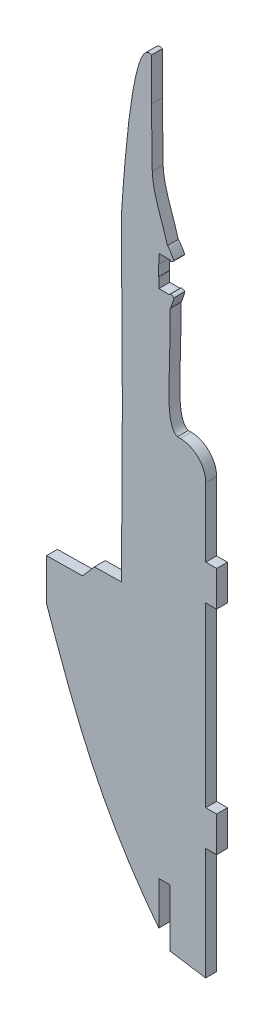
ISO-10303-21;
HEADER;
FILE_DESCRIPTION(('STEP AP214'),'2;1');
FILE_NAME('part.step','',(''),(''),'','','');
FILE_SCHEMA(('AUTOMOTIVE_DESIGN { 1 0 10303 214 1 1 1 1 }'));
ENDSEC;
DATA;
#1=APPLICATION_CONTEXT('core data for automotive mechanical design processes');
#2=APPLICATION_PROTOCOL_DEFINITION('international standard','automotive_design',2000,#1);
#3=PRODUCT_CONTEXT('',#1,'mechanical');
#4=PRODUCT('Part','Part','',(#3));
#5=PRODUCT_RELATED_PRODUCT_CATEGORY('part','',(#4));
#6=PRODUCT_DEFINITION_FORMATION('','',#4);
#7=PRODUCT_DEFINITION_CONTEXT('part definition',#1,'design');
#8=PRODUCT_DEFINITION('design','',#6,#7);
#9=PRODUCT_DEFINITION_SHAPE('','',#8);
#10=(LENGTH_UNIT() NAMED_UNIT(*) SI_UNIT(.MILLI.,.METRE.));
#11=(NAMED_UNIT(*) PLANE_ANGLE_UNIT() SI_UNIT($,.RADIAN.));
#12=(NAMED_UNIT(*) SI_UNIT($,.STERADIAN.) SOLID_ANGLE_UNIT());
#13=UNCERTAINTY_MEASURE_WITH_UNIT(LENGTH_MEASURE(1.E-05),#10,'distance_accuracy_value','');
#14=(GEOMETRIC_REPRESENTATION_CONTEXT(3) GLOBAL_UNCERTAINTY_ASSIGNED_CONTEXT((#13)) GLOBAL_UNIT_ASSIGNED_CONTEXT((#10,
#11,#12)) REPRESENTATION_CONTEXT('',''));
#15=CARTESIAN_POINT('',(0.,0.,0.));
#16=DIRECTION('',(0.,0.,1.));
#17=DIRECTION('',(1.,0.,0.));
#18=AXIS2_PLACEMENT_3D('',#15,#16,#17);
#19=CARTESIAN_POINT('',(622.767748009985,389.896322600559,3.));
#20=CARTESIAN_POINT('',(626.725301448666,378.770128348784,3.));
#21=CARTESIAN_POINT('',(630.715927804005,368.850578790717,3.));
#22=CARTESIAN_POINT('',(635.665840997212,359.365628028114,3.));
#23=B_SPLINE_CURVE_WITH_KNOTS('',3,(#19,#20,#21,#22),.UNSPECIFIED.,.F.,.F.,(4,4),(0.,1.),.UNSPECIFIED.);
#24=DIRECTION('',(0.,0.,-1.));
#25=VECTOR('',#24,1.);
#26=SURFACE_OF_LINEAR_EXTRUSION('',#23,#25);
#27=CARTESIAN_POINT('',(622.767748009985,389.896322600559,0.));
#28=CARTESIAN_POINT('',(626.725301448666,378.770128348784,0.));
#29=CARTESIAN_POINT('',(630.715927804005,368.850578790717,0.));
#30=CARTESIAN_POINT('',(635.665840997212,359.365628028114,0.));
#31=B_SPLINE_CURVE_WITH_KNOTS('',3,(#27,#28,#29,#30),.UNSPECIFIED.,.F.,.F.,(4,4),(0.,1.),.UNSPECIFIED.);
#32=CARTESIAN_POINT('',(622.767748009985,389.896322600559,0.));
#33=VERTEX_POINT('',#32);
#34=CARTESIAN_POINT('',(635.665840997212,359.365628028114,0.));
#35=VERTEX_POINT('',#34);
#36=EDGE_CURVE('E11',#33,#35,#31,.T.);
#37=ORIENTED_EDGE('',*,*,#36,.T.);
#38=DIRECTION('',(0.,0.,-1.));
#39=VECTOR('',#38,1.);
#40=CARTESIAN_POINT('',(635.665840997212,359.365628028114,3.));
#41=LINE('',#40,#39);
#42=CARTESIAN_POINT('',(635.665840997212,359.365628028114,3.));
#43=VERTEX_POINT('',#42);
#44=EDGE_CURVE('E1135',#43,#35,#41,.T.);
#45=ORIENTED_EDGE('',*,*,#44,.F.);
#46=CARTESIAN_POINT('',(622.767748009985,389.896322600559,3.));
#47=VERTEX_POINT('',#46);
#48=EDGE_CURVE('E47',#47,#43,#23,.T.);
#49=ORIENTED_EDGE('',*,*,#48,.F.);
#50=DIRECTION('',(0.,0.,-1.));
#51=VECTOR('',#50,1.);
#52=CARTESIAN_POINT('',(622.767748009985,389.896322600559,3.));
#53=LINE('',#52,#51);
#54=EDGE_CURVE('E406',#47,#33,#53,.T.);
#55=ORIENTED_EDGE('',*,*,#54,.T.);
#56=EDGE_LOOP('',(#37,#45,#49,#55));
#57=FACE_BOUND('',#56,.T.);
#58=ADVANCED_FACE('F44',(#57),#26,.F.);
#59=CARTESIAN_POINT('',(635.844813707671,359.025080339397,3.));
#60=DIRECTION('',(0.88519972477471,0.465211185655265,0.));
#61=DIRECTION('',(-0.465211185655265,0.88519972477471,0.));
#62=AXIS2_PLACEMENT_3D('',#59,#60,#61);
#63=PLANE('',#62);
#64=DIRECTION('',(0.465211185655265,-0.88519972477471,0.));
#65=VECTOR('',#64,1.);
#66=CARTESIAN_POINT('',(635.844813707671,359.025080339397,0.));
#67=LINE('',#66,#65);
#68=CARTESIAN_POINT('',(635.844813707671,359.025080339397,0.));
#69=VERTEX_POINT('',#68);
#70=EDGE_CURVE('E56',#35,#69,#67,.T.);
#71=ORIENTED_EDGE('',*,*,#70,.T.);
#72=DIRECTION('',(0.,0.,-1.));
#73=VECTOR('',#72,1.);
#74=CARTESIAN_POINT('',(635.844813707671,359.025080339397,3.));
#75=LINE('',#74,#73);
#76=CARTESIAN_POINT('',(635.844813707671,359.025080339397,3.));
#77=VERTEX_POINT('',#76);
#78=EDGE_CURVE('E367',#77,#69,#75,.T.);
#79=ORIENTED_EDGE('',*,*,#78,.F.);
#80=DIRECTION('',(0.465211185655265,-0.88519972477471,0.));
#81=VECTOR('',#80,1.);
#82=CARTESIAN_POINT('',(635.844813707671,359.025080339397,3.));
#83=LINE('',#82,#81);
#84=EDGE_CURVE('E213',#43,#77,#83,.T.);
#85=ORIENTED_EDGE('',*,*,#84,.F.);
#86=ORIENTED_EDGE('',*,*,#44,.T.);
#87=EDGE_LOOP('',(#71,#79,#85,#86));
#88=FACE_BOUND('',#87,.T.);
#89=ADVANCED_FACE('F494',(#88),#63,.F.);
#90=CARTESIAN_POINT('',(635.844813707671,359.025080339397,3.));
#91=CARTESIAN_POINT('',(640.033360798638,351.045119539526,3.));
#92=CARTESIAN_POINT('',(644.909204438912,343.366518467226,3.));
#93=CARTESIAN_POINT('',(651.032861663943,335.531165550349,3.));
#94=B_SPLINE_CURVE_WITH_KNOTS('',3,(#90,#91,#92,#93),.UNSPECIFIED.,.F.,.F.,(4,4),(50.,51.),.UNSPECIFIED.);
#95=DIRECTION('',(0.,0.,-1.));
#96=VECTOR('',#95,1.);
#97=SURFACE_OF_LINEAR_EXTRUSION('',#94,#96);
#98=CARTESIAN_POINT('',(635.844813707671,359.025080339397,0.));
#99=CARTESIAN_POINT('',(640.033360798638,351.045119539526,0.));
#100=CARTESIAN_POINT('',(644.909204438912,343.366518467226,0.));
#101=CARTESIAN_POINT('',(651.032861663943,335.531165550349,0.));
#102=B_SPLINE_CURVE_WITH_KNOTS('',3,(#98,#99,#100,#101),.UNSPECIFIED.,.F.,.F.,(4,4),(50.,51.),.UNSPECIFIED.);
#103=CARTESIAN_POINT('',(651.032861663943,335.531165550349,0.));
#104=VERTEX_POINT('',#103);
#105=EDGE_CURVE('E361',#69,#104,#102,.T.);
#106=ORIENTED_EDGE('',*,*,#105,.T.);
#107=DIRECTION('',(0.,0.,-1.));
#108=VECTOR('',#107,1.);
#109=CARTESIAN_POINT('',(651.032861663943,335.531165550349,3.));
#110=LINE('',#109,#108);
#111=CARTESIAN_POINT('',(651.032861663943,335.531165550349,3.));
#112=VERTEX_POINT('',#111);
#113=EDGE_CURVE('E370',#112,#104,#110,.T.);
#114=ORIENTED_EDGE('',*,*,#113,.F.);
#115=EDGE_CURVE('E506',#77,#112,#94,.T.);
#116=ORIENTED_EDGE('',*,*,#115,.F.);
#117=ORIENTED_EDGE('',*,*,#78,.T.);
#118=EDGE_LOOP('',(#106,#114,#116,#117));
#119=FACE_BOUND('',#118,.T.);
#120=ADVANCED_FACE('F362',(#119),#97,.F.);
#121=CARTESIAN_POINT('',(651.032861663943,347.35972864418,3.));
#122=DIRECTION('',(-1.,0.,0.));
#123=DIRECTION('',(0.,0.,1.));
#124=AXIS2_PLACEMENT_3D('',#121,#122,#123);
#125=PLANE('',#124);
#126=DIRECTION('',(0.,1.,0.));
#127=VECTOR('',#126,1.);
#128=CARTESIAN_POINT('',(651.032861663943,347.35972864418,0.));
#129=LINE('',#128,#127);
#130=CARTESIAN_POINT('',(651.032861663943,347.35972864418,0.));
#131=VERTEX_POINT('',#130);
#132=EDGE_CURVE('E375',#104,#131,#129,.T.);
#133=ORIENTED_EDGE('',*,*,#132,.T.);
#134=DIRECTION('',(0.,0.,-1.));
#135=VECTOR('',#134,1.);
#136=CARTESIAN_POINT('',(651.032861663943,347.35972864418,3.));
#137=LINE('',#136,#135);
#138=CARTESIAN_POINT('',(651.032861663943,347.35972864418,3.));
#139=VERTEX_POINT('',#138);
#140=EDGE_CURVE('E379',#139,#131,#137,.T.);
#141=ORIENTED_EDGE('',*,*,#140,.F.);
#142=DIRECTION('',(0.,1.,0.));
#143=VECTOR('',#142,1.);
#144=CARTESIAN_POINT('',(651.032861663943,347.35972864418,3.));
#145=LINE('',#144,#143);
#146=EDGE_CURVE('E377',#112,#139,#145,.T.);
#147=ORIENTED_EDGE('',*,*,#146,.F.);
#148=ORIENTED_EDGE('',*,*,#113,.T.);
#149=EDGE_LOOP('',(#133,#141,#147,#148));
#150=FACE_BOUND('',#149,.T.);
#151=ADVANCED_FACE('F374',(#150),#125,.F.);
#152=CARTESIAN_POINT('',(654.032850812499,347.35972864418,3.));
#153=DIRECTION('',(0.,1.,0.));
#154=DIRECTION('',(0.,0.,1.));
#155=AXIS2_PLACEMENT_3D('',#152,#153,#154);
#156=PLANE('',#155);
#157=DIRECTION('',(1.,0.,0.));
#158=VECTOR('',#157,1.);
#159=CARTESIAN_POINT('',(654.032850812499,347.35972864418,0.));
#160=LINE('',#159,#158);
#161=CARTESIAN_POINT('',(654.032850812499,347.35972864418,0.));
#162=VERTEX_POINT('',#161);
#163=EDGE_CURVE('E383',#131,#162,#160,.T.);
#164=ORIENTED_EDGE('',*,*,#163,.T.);
#165=DIRECTION('',(0.,0.,-1.));
#166=VECTOR('',#165,1.);
#167=CARTESIAN_POINT('',(654.032850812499,347.35972864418,3.));
#168=LINE('',#167,#166);
#169=CARTESIAN_POINT('',(654.032850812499,347.35972864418,3.));
#170=VERTEX_POINT('',#169);
#171=EDGE_CURVE('E722',#170,#162,#168,.T.);
#172=ORIENTED_EDGE('',*,*,#171,.F.);
#173=DIRECTION('',(1.,0.,0.));
#174=VECTOR('',#173,1.);
#175=CARTESIAN_POINT('',(654.032850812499,347.35972864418,3.));
#176=LINE('',#175,#174);
#177=EDGE_CURVE('E1119',#139,#170,#176,.T.);
#178=ORIENTED_EDGE('',*,*,#177,.F.);
#179=ORIENTED_EDGE('',*,*,#140,.T.);
#180=EDGE_LOOP('',(#164,#172,#178,#179));
#181=FACE_BOUND('',#180,.T.);
#182=ADVANCED_FACE('F1127',(#181),#156,.F.);
#183=CARTESIAN_POINT('',(654.032850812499,331.711932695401,3.));
#184=DIRECTION('',(1.,0.,0.));
#185=DIRECTION('',(0.,0.,-1.));
#186=AXIS2_PLACEMENT_3D('',#183,#184,#185);
#187=PLANE('',#186);
#188=DIRECTION('',(0.,-1.,0.));
#189=VECTOR('',#188,1.);
#190=CARTESIAN_POINT('',(654.032850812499,331.711932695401,0.));
#191=LINE('',#190,#189);
#192=CARTESIAN_POINT('',(654.032850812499,331.711932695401,0.));
#193=VERTEX_POINT('',#192);
#194=EDGE_CURVE('E386',#162,#193,#191,.T.);
#195=ORIENTED_EDGE('',*,*,#194,.T.);
#196=DIRECTION('',(0.,0.,-1.));
#197=VECTOR('',#196,1.);
#198=CARTESIAN_POINT('',(654.032850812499,331.711932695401,3.));
#199=LINE('',#198,#197);
#200=CARTESIAN_POINT('',(654.032850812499,331.711932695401,3.));
#201=VERTEX_POINT('',#200);
#202=EDGE_CURVE('E721',#201,#193,#199,.T.);
#203=ORIENTED_EDGE('',*,*,#202,.F.);
#204=DIRECTION('',(0.,-1.,0.));
#205=VECTOR('',#204,1.);
#206=CARTESIAN_POINT('',(654.032850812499,331.711932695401,3.));
#207=LINE('',#206,#205);
#208=EDGE_CURVE('E1120',#170,#201,#207,.T.);
#209=ORIENTED_EDGE('',*,*,#208,.F.);
#210=ORIENTED_EDGE('',*,*,#171,.T.);
#211=EDGE_LOOP('',(#195,#203,#209,#210));
#212=FACE_BOUND('',#211,.T.);
#213=ADVANCED_FACE('F716',(#212),#187,.F.);
#214=CARTESIAN_POINT('',(654.164367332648,331.545190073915,3.));
#215=DIRECTION('',(0.78516297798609,0.619289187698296,0.));
#216=DIRECTION('',(-0.619289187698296,0.78516297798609,0.));
#217=AXIS2_PLACEMENT_3D('',#214,#215,#216);
#218=PLANE('',#217);
#219=DIRECTION('',(0.619289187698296,-0.78516297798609,0.));
#220=VECTOR('',#219,1.);
#221=CARTESIAN_POINT('',(654.164367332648,331.545190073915,0.));
#222=LINE('',#221,#220);
#223=CARTESIAN_POINT('',(654.164367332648,331.545190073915,0.));
#224=VERTEX_POINT('',#223);
#225=EDGE_CURVE('E715',#193,#224,#222,.T.);
#226=ORIENTED_EDGE('',*,*,#225,.T.);
#227=DIRECTION('',(0.,0.,-1.));
#228=VECTOR('',#227,1.);
#229=CARTESIAN_POINT('',(654.164367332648,331.545190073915,3.));
#230=LINE('',#229,#228);
#231=CARTESIAN_POINT('',(654.164367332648,331.545190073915,3.));
#232=VERTEX_POINT('',#231);
#233=EDGE_CURVE('E735',#232,#224,#230,.T.);
#234=ORIENTED_EDGE('',*,*,#233,.F.);
#235=DIRECTION('',(0.619289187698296,-0.78516297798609,0.));
#236=VECTOR('',#235,1.);
#237=CARTESIAN_POINT('',(654.164367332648,331.545190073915,3.));
#238=LINE('',#237,#236);
#239=EDGE_CURVE('E728',#201,#232,#238,.T.);
#240=ORIENTED_EDGE('',*,*,#239,.F.);
#241=ORIENTED_EDGE('',*,*,#202,.T.);
#242=EDGE_LOOP('',(#226,#234,#240,#241));
#243=FACE_BOUND('',#242,.T.);
#244=ADVANCED_FACE('F730',(#243),#218,.F.);
#245=CARTESIAN_POINT('',(663.94025640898,330.068191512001,3.));
#246=DIRECTION('',(0.149390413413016,0.988778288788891,0.));
#247=DIRECTION('',(-0.988778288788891,0.149390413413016,0.));
#248=AXIS2_PLACEMENT_3D('',#245,#246,#247);
#249=PLANE('',#248);
#250=DIRECTION('',(0.988778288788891,-0.149390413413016,0.));
#251=VECTOR('',#250,1.);
#252=CARTESIAN_POINT('',(663.94025640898,330.068191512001,0.));
#253=LINE('',#252,#251);
#254=CARTESIAN_POINT('',(663.94025640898,330.068191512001,0.));
#255=VERTEX_POINT('',#254);
#256=EDGE_CURVE('E706',#224,#255,#253,.T.);
#257=ORIENTED_EDGE('',*,*,#256,.T.);
#258=DIRECTION('',(0.,0.,-1.));
#259=VECTOR('',#258,1.);
#260=CARTESIAN_POINT('',(663.94025640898,330.068191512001,3.));
#261=LINE('',#260,#259);
#262=CARTESIAN_POINT('',(663.94025640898,330.068191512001,3.));
#263=VERTEX_POINT('',#262);
#264=EDGE_CURVE('E745',#263,#255,#261,.T.);
#265=ORIENTED_EDGE('',*,*,#264,.F.);
#266=DIRECTION('',(0.988778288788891,-0.149390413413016,0.));
#267=VECTOR('',#266,1.);
#268=CARTESIAN_POINT('',(663.94025640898,330.068191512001,3.));
#269=LINE('',#268,#267);
#270=EDGE_CURVE('E1110',#232,#263,#269,.T.);
#271=ORIENTED_EDGE('',*,*,#270,.F.);
#272=ORIENTED_EDGE('',*,*,#233,.T.);
#273=EDGE_LOOP('',(#257,#265,#271,#272));
#274=FACE_BOUND('',#273,.T.);
#275=ADVANCED_FACE('F738',(#274),#249,.F.);
#276=CARTESIAN_POINT('',(663.94025640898,360.994985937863,3.));
#277=DIRECTION('',(-1.,0.,0.));
#278=DIRECTION('',(0.,0.,1.));
#279=AXIS2_PLACEMENT_3D('',#276,#277,#278);
#280=PLANE('',#279);
#281=DIRECTION('',(0.,1.,0.));
#282=VECTOR('',#281,1.);
#283=CARTESIAN_POINT('',(663.94025640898,360.994985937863,0.));
#284=LINE('',#283,#282);
#285=CARTESIAN_POINT('',(663.94025640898,360.994985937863,0.));
#286=VERTEX_POINT('',#285);
#287=EDGE_CURVE('E707',#255,#286,#284,.T.);
#288=ORIENTED_EDGE('',*,*,#287,.T.);
#289=DIRECTION('',(0.,0.,-1.));
#290=VECTOR('',#289,1.);
#291=CARTESIAN_POINT('',(663.94025640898,360.994985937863,3.));
#292=LINE('',#291,#290);
#293=CARTESIAN_POINT('',(663.94025640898,360.994985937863,3.));
#294=VERTEX_POINT('',#293);
#295=EDGE_CURVE('E749',#294,#286,#292,.T.);
#296=ORIENTED_EDGE('',*,*,#295,.F.);
#297=DIRECTION('',(0.,1.,0.));
#298=VECTOR('',#297,1.);
#299=CARTESIAN_POINT('',(663.94025640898,360.994985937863,3.));
#300=LINE('',#299,#298);
#301=EDGE_CURVE('E746',#263,#294,#300,.T.);
#302=ORIENTED_EDGE('',*,*,#301,.F.);
#303=ORIENTED_EDGE('',*,*,#264,.T.);
#304=EDGE_LOOP('',(#288,#296,#302,#303));
#305=FACE_BOUND('',#304,.T.);
#306=ADVANCED_FACE('F744',(#305),#280,.F.);
#307=CARTESIAN_POINT('',(666.948772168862,360.994985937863,3.));
#308=DIRECTION('',(0.,1.,0.));
#309=DIRECTION('',(0.,0.,1.));
#310=AXIS2_PLACEMENT_3D('',#307,#308,#309);
#311=PLANE('',#310);
#312=DIRECTION('',(1.,0.,0.));
#313=VECTOR('',#312,1.);
#314=CARTESIAN_POINT('',(666.948772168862,360.994985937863,0.));
#315=LINE('',#314,#313);
#316=CARTESIAN_POINT('',(666.948772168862,360.994985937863,0.));
#317=VERTEX_POINT('',#316);
#318=EDGE_CURVE('E702',#286,#317,#315,.T.);
#319=ORIENTED_EDGE('',*,*,#318,.T.);
#320=DIRECTION('',(0.,0.,-1.));
#321=VECTOR('',#320,1.);
#322=CARTESIAN_POINT('',(666.948772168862,360.994985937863,3.));
#323=LINE('',#322,#321);
#324=CARTESIAN_POINT('',(666.948772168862,360.994985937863,3.));
#325=VERTEX_POINT('',#324);
#326=EDGE_CURVE('E754',#325,#317,#323,.T.);
#327=ORIENTED_EDGE('',*,*,#326,.F.);
#328=DIRECTION('',(1.,0.,0.));
#329=VECTOR('',#328,1.);
#330=CARTESIAN_POINT('',(666.948772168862,360.994985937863,3.));
#331=LINE('',#330,#329);
#332=EDGE_CURVE('E1104',#294,#325,#331,.T.);
#333=ORIENTED_EDGE('',*,*,#332,.F.);
#334=ORIENTED_EDGE('',*,*,#295,.T.);
#335=EDGE_LOOP('',(#319,#327,#333,#334));
#336=FACE_BOUND('',#335,.T.);
#337=ADVANCED_FACE('F1105',(#336),#311,.F.);
#338=CARTESIAN_POINT('',(666.948772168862,370.711619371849,3.));
#339=DIRECTION('',(-1.,0.,0.));
#340=DIRECTION('',(0.,0.,1.));
#341=AXIS2_PLACEMENT_3D('',#338,#339,#340);
#342=PLANE('',#341);
#343=DIRECTION('',(0.,1.,0.));
#344=VECTOR('',#343,1.);
#345=CARTESIAN_POINT('',(666.948772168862,370.711619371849,0.));
#346=LINE('',#345,#344);
#347=CARTESIAN_POINT('',(666.948772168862,370.711619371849,0.));
#348=VERTEX_POINT('',#347);
#349=EDGE_CURVE('E699',#317,#348,#346,.T.);
#350=ORIENTED_EDGE('',*,*,#349,.T.);
#351=DIRECTION('',(0.,0.,-1.));
#352=VECTOR('',#351,1.);
#353=CARTESIAN_POINT('',(666.948772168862,370.711619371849,3.));
#354=LINE('',#353,#352);
#355=CARTESIAN_POINT('',(666.948772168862,370.711619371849,3.));
#356=VERTEX_POINT('',#355);
#357=EDGE_CURVE('E761',#356,#348,#354,.T.);
#358=ORIENTED_EDGE('',*,*,#357,.F.);
#359=DIRECTION('',(0.,1.,0.));
#360=VECTOR('',#359,1.);
#361=CARTESIAN_POINT('',(666.948772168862,370.711619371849,3.));
#362=LINE('',#361,#360);
#363=EDGE_CURVE('E1096',#325,#356,#362,.T.);
#364=ORIENTED_EDGE('',*,*,#363,.F.);
#365=ORIENTED_EDGE('',*,*,#326,.T.);
#366=EDGE_LOOP('',(#350,#358,#364,#365));
#367=FACE_BOUND('',#366,.T.);
#368=ADVANCED_FACE('F1097',(#367),#342,.F.);
#369=CARTESIAN_POINT('',(663.94025640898,370.711619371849,3.));
#370=DIRECTION('',(0.,-1.,0.));
#371=DIRECTION('',(0.,0.,-1.));
#372=AXIS2_PLACEMENT_3D('',#369,#370,#371);
#373=PLANE('',#372);
#374=DIRECTION('',(-1.,0.,0.));
#375=VECTOR('',#374,1.);
#376=CARTESIAN_POINT('',(663.94025640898,370.711619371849,0.));
#377=LINE('',#376,#375);
#378=CARTESIAN_POINT('',(663.94025640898,370.711619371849,0.));
#379=VERTEX_POINT('',#378);
#380=EDGE_CURVE('E696',#348,#379,#377,.T.);
#381=ORIENTED_EDGE('',*,*,#380,.T.);
#382=DIRECTION('',(0.,0.,-1.));
#383=VECTOR('',#382,1.);
#384=CARTESIAN_POINT('',(663.94025640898,370.711619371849,3.));
#385=LINE('',#384,#383);
#386=CARTESIAN_POINT('',(663.94025640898,370.711619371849,3.));
#387=VERTEX_POINT('',#386);
#388=EDGE_CURVE('E764',#387,#379,#385,.T.);
#389=ORIENTED_EDGE('',*,*,#388,.F.);
#390=DIRECTION('',(-1.,0.,0.));
#391=VECTOR('',#390,1.);
#392=CARTESIAN_POINT('',(663.94025640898,370.711619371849,3.));
#393=LINE('',#392,#391);
#394=EDGE_CURVE('E1095',#356,#387,#393,.T.);
#395=ORIENTED_EDGE('',*,*,#394,.F.);
#396=ORIENTED_EDGE('',*,*,#357,.T.);
#397=EDGE_LOOP('',(#381,#389,#395,#396));
#398=FACE_BOUND('',#397,.T.);
#399=ADVANCED_FACE('F1091',(#398),#373,.F.);
#400=CARTESIAN_POINT('',(663.94025640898,419.602175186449,3.));
#401=DIRECTION('',(-1.,0.,0.));
#402=DIRECTION('',(0.,0.,1.));
#403=AXIS2_PLACEMENT_3D('',#400,#401,#402);
#404=PLANE('',#403);
#405=DIRECTION('',(0.,1.,0.));
#406=VECTOR('',#405,1.);
#407=CARTESIAN_POINT('',(663.94025640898,419.602175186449,0.));
#408=LINE('',#407,#406);
#409=CARTESIAN_POINT('',(663.94025640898,419.602175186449,0.));
#410=VERTEX_POINT('',#409);
#411=EDGE_CURVE('E693',#379,#410,#408,.T.);
#412=ORIENTED_EDGE('',*,*,#411,.T.);
#413=DIRECTION('',(0.,0.,-1.));
#414=VECTOR('',#413,1.);
#415=CARTESIAN_POINT('',(663.94025640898,419.602175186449,3.));
#416=LINE('',#415,#414);
#417=CARTESIAN_POINT('',(663.94025640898,419.602175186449,3.));
#418=VERTEX_POINT('',#417);
#419=EDGE_CURVE('E768',#418,#410,#416,.T.);
#420=ORIENTED_EDGE('',*,*,#419,.F.);
#421=DIRECTION('',(0.,1.,0.));
#422=VECTOR('',#421,1.);
#423=CARTESIAN_POINT('',(663.94025640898,383.689207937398,3.));
#424=LINE('',#423,#422);
#425=EDGE_CURVE('E1090',#387,#418,#424,.T.);
#426=ORIENTED_EDGE('',*,*,#425,.F.);
#427=ORIENTED_EDGE('',*,*,#388,.T.);
#428=EDGE_LOOP('',(#412,#420,#426,#427));
#429=FACE_BOUND('',#428,.T.);
#430=ADVANCED_FACE('F1086',(#429),#404,.F.);
#431=CARTESIAN_POINT('',(666.948772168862,419.602175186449,3.));
#432=DIRECTION('',(0.,1.,0.));
#433=DIRECTION('',(0.,0.,1.));
#434=AXIS2_PLACEMENT_3D('',#431,#432,#433);
#435=PLANE('',#434);
#436=DIRECTION('',(1.,0.,0.));
#437=VECTOR('',#436,1.);
#438=CARTESIAN_POINT('',(666.948772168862,419.602175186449,0.));
#439=LINE('',#438,#437);
#440=CARTESIAN_POINT('',(666.948772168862,419.602175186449,0.));
#441=VERTEX_POINT('',#440);
#442=EDGE_CURVE('E687',#410,#441,#439,.T.);
#443=ORIENTED_EDGE('',*,*,#442,.T.);
#444=DIRECTION('',(0.,0.,-1.));
#445=VECTOR('',#444,1.);
#446=CARTESIAN_POINT('',(666.948772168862,419.602175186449,3.));
#447=LINE('',#446,#445);
#448=CARTESIAN_POINT('',(666.948772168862,419.602175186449,3.));
#449=VERTEX_POINT('',#448);
#450=EDGE_CURVE('E774',#449,#441,#447,.T.);
#451=ORIENTED_EDGE('',*,*,#450,.F.);
#452=DIRECTION('',(1.,0.,0.));
#453=VECTOR('',#452,1.);
#454=CARTESIAN_POINT('',(666.948772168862,419.602175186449,3.));
#455=LINE('',#454,#453);
#456=EDGE_CURVE('E1083',#418,#449,#455,.T.);
#457=ORIENTED_EDGE('',*,*,#456,.F.);
#458=ORIENTED_EDGE('',*,*,#419,.T.);
#459=EDGE_LOOP('',(#443,#451,#457,#458));
#460=FACE_BOUND('',#459,.T.);
#461=ADVANCED_FACE('F1077',(#460),#435,.F.);
#462=CARTESIAN_POINT('',(666.948772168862,429.318722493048,3.));
#463=DIRECTION('',(-1.,0.,0.));
#464=DIRECTION('',(0.,0.,1.));
#465=AXIS2_PLACEMENT_3D('',#462,#463,#464);
#466=PLANE('',#465);
#467=DIRECTION('',(0.,1.,0.));
#468=VECTOR('',#467,1.);
#469=CARTESIAN_POINT('',(666.948772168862,429.318722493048,0.));
#470=LINE('',#469,#468);
#471=CARTESIAN_POINT('',(666.948772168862,429.318722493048,0.));
#472=VERTEX_POINT('',#471);
#473=EDGE_CURVE('E690',#441,#472,#470,.T.);
#474=ORIENTED_EDGE('',*,*,#473,.T.);
#475=DIRECTION('',(0.,0.,-1.));
#476=VECTOR('',#475,1.);
#477=CARTESIAN_POINT('',(666.948772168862,429.318722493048,3.));
#478=LINE('',#477,#476);
#479=CARTESIAN_POINT('',(666.948772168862,429.318722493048,3.));
#480=VERTEX_POINT('',#479);
#481=EDGE_CURVE('E780',#480,#472,#478,.T.);
#482=ORIENTED_EDGE('',*,*,#481,.F.);
#483=DIRECTION('',(0.,1.,0.));
#484=VECTOR('',#483,1.);
#485=CARTESIAN_POINT('',(666.948772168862,429.318722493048,3.));
#486=LINE('',#485,#484);
#487=EDGE_CURVE('E1074',#449,#480,#486,.T.);
#488=ORIENTED_EDGE('',*,*,#487,.F.);
#489=ORIENTED_EDGE('',*,*,#450,.T.);
#490=EDGE_LOOP('',(#474,#482,#488,#489));
#491=FACE_BOUND('',#490,.T.);
#492=ADVANCED_FACE('F1075',(#491),#466,.F.);
#493=CARTESIAN_POINT('',(663.94025640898,429.318722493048,3.));
#494=DIRECTION('',(0.,-1.,0.));
#495=DIRECTION('',(0.,0.,-1.));
#496=AXIS2_PLACEMENT_3D('',#493,#494,#495);
#497=PLANE('',#496);
#498=DIRECTION('',(-1.,0.,0.));
#499=VECTOR('',#498,1.);
#500=CARTESIAN_POINT('',(663.94025640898,429.318722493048,0.));
#501=LINE('',#500,#499);
#502=CARTESIAN_POINT('',(663.94025640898,429.318722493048,0.));
#503=VERTEX_POINT('',#502);
#504=EDGE_CURVE('E685',#472,#503,#501,.T.);
#505=ORIENTED_EDGE('',*,*,#504,.T.);
#506=DIRECTION('',(0.,0.,-1.));
#507=VECTOR('',#506,1.);
#508=CARTESIAN_POINT('',(663.94025640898,429.318722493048,3.));
#509=LINE('',#508,#507);
#510=CARTESIAN_POINT('',(663.94025640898,429.318722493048,3.));
#511=VERTEX_POINT('',#510);
#512=EDGE_CURVE('E782',#511,#503,#509,.T.);
#513=ORIENTED_EDGE('',*,*,#512,.F.);
#514=DIRECTION('',(-1.,0.,0.));
#515=VECTOR('',#514,1.);
#516=CARTESIAN_POINT('',(663.94025640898,429.318722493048,3.));
#517=LINE('',#516,#515);
#518=EDGE_CURVE('E1069',#480,#511,#517,.T.);
#519=ORIENTED_EDGE('',*,*,#518,.F.);
#520=ORIENTED_EDGE('',*,*,#481,.T.);
#521=EDGE_LOOP('',(#505,#513,#519,#520));
#522=FACE_BOUND('',#521,.T.);
#523=ADVANCED_FACE('F1067',(#522),#497,.F.);
#524=CARTESIAN_POINT('',(663.94025640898,448.279666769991,3.));
#525=DIRECTION('',(-1.,0.,0.));
#526=DIRECTION('',(0.,0.,1.));
#527=AXIS2_PLACEMENT_3D('',#524,#525,#526);
#528=PLANE('',#527);
#529=DIRECTION('',(0.,1.,0.));
#530=VECTOR('',#529,1.);
#531=CARTESIAN_POINT('',(663.94025640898,448.279666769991,0.));
#532=LINE('',#531,#530);
#533=CARTESIAN_POINT('',(663.94025640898,448.279666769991,0.));
#534=VERTEX_POINT('',#533);
#535=EDGE_CURVE('E678',#503,#534,#532,.T.);
#536=ORIENTED_EDGE('',*,*,#535,.T.);
#537=DIRECTION('',(0.,0.,-1.));
#538=VECTOR('',#537,1.);
#539=CARTESIAN_POINT('',(663.94025640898,448.279666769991,3.));
#540=LINE('',#539,#538);
#541=CARTESIAN_POINT('',(663.94025640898,448.279666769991,3.));
#542=VERTEX_POINT('',#541);
#543=EDGE_CURVE('E783',#542,#534,#540,.T.);
#544=ORIENTED_EDGE('',*,*,#543,.F.);
#545=DIRECTION('',(0.,1.,0.));
#546=VECTOR('',#545,1.);
#547=CARTESIAN_POINT('',(663.94025640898,448.279666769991,3.));
#548=LINE('',#547,#546);
#549=EDGE_CURVE('E1066',#511,#542,#548,.T.);
#550=ORIENTED_EDGE('',*,*,#549,.F.);
#551=ORIENTED_EDGE('',*,*,#512,.T.);
#552=EDGE_LOOP('',(#536,#544,#550,#551));
#553=FACE_BOUND('',#552,.T.);
#554=ADVANCED_FACE('F1065',(#553),#528,.F.);
#555=CARTESIAN_POINT('',(663.94025640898,448.279666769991,3.));
#556=CARTESIAN_POINT('',(663.94025640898,452.165992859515,3.));
#557=CARTESIAN_POINT('',(660.800654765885,455.322303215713,3.));
#558=CARTESIAN_POINT('',(656.914328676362,455.342973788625,3.));
#559=B_SPLINE_CURVE_WITH_KNOTS('',3,(#555,#556,#557,#558),.UNSPECIFIED.,.F.,.F.,(4,4),(33.,34.),.UNSPECIFIED.);
#560=DIRECTION('',(0.,0.,-1.));
#561=VECTOR('',#560,1.);
#562=SURFACE_OF_LINEAR_EXTRUSION('',#559,#561);
#563=CARTESIAN_POINT('',(663.94025640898,448.279666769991,0.));
#564=CARTESIAN_POINT('',(663.94025640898,452.165992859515,0.));
#565=CARTESIAN_POINT('',(660.800654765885,455.322303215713,0.));
#566=CARTESIAN_POINT('',(656.914328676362,455.342973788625,0.));
#567=B_SPLINE_CURVE_WITH_KNOTS('',3,(#563,#564,#565,#566),.UNSPECIFIED.,.F.,.F.,(4,4),(33.,34.),.UNSPECIFIED.);
#568=CARTESIAN_POINT('',(656.914328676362,455.342973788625,0.));
#569=VERTEX_POINT('',#568);
#570=EDGE_CURVE('E675',#534,#569,#567,.T.);
#571=ORIENTED_EDGE('',*,*,#570,.T.);
#572=DIRECTION('',(0.,0.,-1.));
#573=VECTOR('',#572,1.);
#574=CARTESIAN_POINT('',(656.914328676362,455.342973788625,3.));
#575=LINE('',#574,#573);
#576=CARTESIAN_POINT('',(656.914328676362,455.342973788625,3.));
#577=VERTEX_POINT('',#576);
#578=EDGE_CURVE('E787',#577,#569,#575,.T.);
#579=ORIENTED_EDGE('',*,*,#578,.F.);
#580=EDGE_CURVE('E1060',#542,#577,#559,.T.);
#581=ORIENTED_EDGE('',*,*,#580,.F.);
#582=ORIENTED_EDGE('',*,*,#543,.T.);
#583=EDGE_LOOP('',(#571,#579,#581,#582));
#584=FACE_BOUND('',#583,.T.);
#585=ADVANCED_FACE('F1057',(#584),#562,.F.);
#586=CARTESIAN_POINT('',(656.122817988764,455.347194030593,3.));
#587=DIRECTION('',(-0.00533180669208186,-0.999985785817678,0.));
#588=DIRECTION('',(0.999985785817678,-0.00533180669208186,0.));
#589=AXIS2_PLACEMENT_3D('',#586,#587,#588);
#590=PLANE('',#589);
#591=DIRECTION('',(-0.999985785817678,0.00533180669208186,0.));
#592=VECTOR('',#591,1.);
#593=CARTESIAN_POINT('',(656.122817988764,455.347194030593,0.));
#594=LINE('',#593,#592);
#595=CARTESIAN_POINT('',(656.122817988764,455.347194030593,0.));
#596=VERTEX_POINT('',#595);
#597=EDGE_CURVE('E670',#569,#596,#594,.T.);
#598=ORIENTED_EDGE('',*,*,#597,.T.);
#599=DIRECTION('',(0.,0.,-1.));
#600=VECTOR('',#599,1.);
#601=CARTESIAN_POINT('',(656.122817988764,455.347194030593,3.));
#602=LINE('',#601,#600);
#603=CARTESIAN_POINT('',(656.122817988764,455.347194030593,3.));
#604=VERTEX_POINT('',#603);
#605=EDGE_CURVE('E791',#604,#596,#602,.T.);
#606=ORIENTED_EDGE('',*,*,#605,.F.);
#607=DIRECTION('',(-0.999985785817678,0.00533180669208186,0.));
#608=VECTOR('',#607,1.);
#609=CARTESIAN_POINT('',(656.122817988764,455.347194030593,3.));
#610=LINE('',#609,#608);
#611=EDGE_CURVE('E1055',#577,#604,#610,.T.);
#612=ORIENTED_EDGE('',*,*,#611,.F.);
#613=ORIENTED_EDGE('',*,*,#578,.T.);
#614=EDGE_LOOP('',(#598,#606,#612,#613));
#615=FACE_BOUND('',#614,.T.);
#616=ADVANCED_FACE('F1052',(#615),#590,.F.);
#617=CARTESIAN_POINT('',(656.122817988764,455.347194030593,3.));
#618=CARTESIAN_POINT('',(652.276541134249,457.143294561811,3.));
#619=CARTESIAN_POINT('',(654.407074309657,469.988074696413,3.));
#620=CARTESIAN_POINT('',(654.106575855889,484.956928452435,3.));
#621=B_SPLINE_CURVE_WITH_KNOTS('',3,(#617,#618,#619,#620),.UNSPECIFIED.,.F.,.F.,(4,4),(31.,32.),.UNSPECIFIED.);
#622=DIRECTION('',(0.,0.,-1.));
#623=VECTOR('',#622,1.);
#624=SURFACE_OF_LINEAR_EXTRUSION('',#621,#623);
#625=CARTESIAN_POINT('',(656.122817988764,455.347194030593,0.));
#626=CARTESIAN_POINT('',(652.276541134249,457.143294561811,0.));
#627=CARTESIAN_POINT('',(654.407074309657,469.988074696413,0.));
#628=CARTESIAN_POINT('',(654.106575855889,484.956928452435,0.));
#629=B_SPLINE_CURVE_WITH_KNOTS('',3,(#625,#626,#627,#628),.UNSPECIFIED.,.F.,.F.,(4,4),(31.,32.),.UNSPECIFIED.);
#630=CARTESIAN_POINT('',(654.106575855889,484.956928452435,0.));
#631=VERTEX_POINT('',#630);
#632=EDGE_CURVE('E657',#596,#631,#629,.T.);
#633=ORIENTED_EDGE('',*,*,#632,.T.);
#634=DIRECTION('',(0.,0.,-1.));
#635=VECTOR('',#634,1.);
#636=CARTESIAN_POINT('',(654.106575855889,484.956928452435,3.));
#637=LINE('',#636,#635);
#638=CARTESIAN_POINT('',(654.106575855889,484.956928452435,3.));
#639=VERTEX_POINT('',#638);
#640=EDGE_CURVE('E800',#639,#631,#637,.T.);
#641=ORIENTED_EDGE('',*,*,#640,.F.);
#642=EDGE_CURVE('E1048',#604,#639,#621,.T.);
#643=ORIENTED_EDGE('',*,*,#642,.F.);
#644=ORIENTED_EDGE('',*,*,#605,.T.);
#645=EDGE_LOOP('',(#633,#641,#643,#644));
#646=FACE_BOUND('',#645,.T.);
#647=ADVANCED_FACE('F1043',(#646),#624,.F.);
#648=CARTESIAN_POINT('',(654.106575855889,484.956928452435,3.));
#649=CARTESIAN_POINT('',(654.109934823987,484.956067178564,3.));
#650=CARTESIAN_POINT('',(654.112777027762,484.949435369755,3.));
#651=CARTESIAN_POINT('',(654.116222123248,484.950555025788,3.));
#652=B_SPLINE_CURVE_WITH_KNOTS('',3,(#648,#649,#650,#651),.UNSPECIFIED.,.F.,.F.,(4,4),(30.,31.),.UNSPECIFIED.);
#653=DIRECTION('',(0.,0.,-1.));
#654=VECTOR('',#653,1.);
#655=SURFACE_OF_LINEAR_EXTRUSION('',#652,#654);
#656=CARTESIAN_POINT('',(654.106575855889,484.956928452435,0.));
#657=CARTESIAN_POINT('',(654.109934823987,484.956067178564,0.));
#658=CARTESIAN_POINT('',(654.112777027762,484.949435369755,0.));
#659=CARTESIAN_POINT('',(654.116222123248,484.950555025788,0.));
#660=B_SPLINE_CURVE_WITH_KNOTS('',3,(#656,#657,#658,#659),.UNSPECIFIED.,.F.,.F.,(4,4),(30.,31.),.UNSPECIFIED.);
#661=CARTESIAN_POINT('',(654.116222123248,484.950555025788,0.));
#662=VERTEX_POINT('',#661);
#663=EDGE_CURVE('E652',#631,#662,#660,.T.);
#664=ORIENTED_EDGE('',*,*,#663,.T.);
#665=DIRECTION('',(0.,0.,-1.));
#666=VECTOR('',#665,1.);
#667=CARTESIAN_POINT('',(654.116222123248,484.950555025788,3.));
#668=LINE('',#667,#666);
#669=CARTESIAN_POINT('',(654.116222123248,484.950555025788,3.));
#670=VERTEX_POINT('',#669);
#671=EDGE_CURVE('E802',#670,#662,#668,.T.);
#672=ORIENTED_EDGE('',*,*,#671,.F.);
#673=EDGE_CURVE('E1036',#639,#670,#652,.T.);
#674=ORIENTED_EDGE('',*,*,#673,.F.);
#675=ORIENTED_EDGE('',*,*,#640,.T.);
#676=EDGE_LOOP('',(#664,#672,#674,#675));
#677=FACE_BOUND('',#676,.T.);
#678=ADVANCED_FACE('F1039',(#677),#655,.F.);
#679=CARTESIAN_POINT('',(654.116222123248,484.950555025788,3.));
#680=CARTESIAN_POINT('',(654.311645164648,485.009293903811,3.));
#681=CARTESIAN_POINT('',(655.226662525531,487.783543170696,3.));
#682=CARTESIAN_POINT('',(655.167923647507,487.978880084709,3.));
#683=B_SPLINE_CURVE_WITH_KNOTS('',3,(#679,#680,#681,#682),.UNSPECIFIED.,.F.,.F.,(4,4),(29.,30.),.UNSPECIFIED.);
#684=DIRECTION('',(0.,0.,-1.));
#685=VECTOR('',#684,1.);
#686=SURFACE_OF_LINEAR_EXTRUSION('',#683,#685);
#687=CARTESIAN_POINT('',(654.116222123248,484.950555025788,0.));
#688=CARTESIAN_POINT('',(654.311645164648,485.009293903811,0.));
#689=CARTESIAN_POINT('',(655.226662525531,487.783543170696,0.));
#690=CARTESIAN_POINT('',(655.167923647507,487.978880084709,0.));
#691=B_SPLINE_CURVE_WITH_KNOTS('',3,(#687,#688,#689,#690),.UNSPECIFIED.,.F.,.F.,(4,4),(29.,30.),.UNSPECIFIED.);
#692=CARTESIAN_POINT('',(655.167923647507,487.978880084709,0.));
#693=VERTEX_POINT('',#692);
#694=EDGE_CURVE('E644',#662,#693,#691,.T.);
#695=ORIENTED_EDGE('',*,*,#694,.T.);
#696=DIRECTION('',(0.,0.,-1.));
#697=VECTOR('',#696,1.);
#698=CARTESIAN_POINT('',(655.167923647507,487.978880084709,3.));
#699=LINE('',#698,#697);
#700=CARTESIAN_POINT('',(655.167923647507,487.978880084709,3.));
#701=VERTEX_POINT('',#700);
#702=EDGE_CURVE('E803',#701,#693,#699,.T.);
#703=ORIENTED_EDGE('',*,*,#702,.F.);
#704=EDGE_CURVE('E1031',#670,#701,#683,.T.);
#705=ORIENTED_EDGE('',*,*,#704,.F.);
#706=ORIENTED_EDGE('',*,*,#671,.T.);
#707=EDGE_LOOP('',(#695,#703,#705,#706));
#708=FACE_BOUND('',#707,.T.);
#709=ADVANCED_FACE('F1034',(#708),#686,.F.);
#710=CARTESIAN_POINT('',(655.167923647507,487.978880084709,3.));
#711=CARTESIAN_POINT('',(655.10918476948,488.174303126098,3.));
#712=CARTESIAN_POINT('',(654.407849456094,488.487462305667,3.));
#713=CARTESIAN_POINT('',(654.212512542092,488.428809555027,3.));
#714=B_SPLINE_CURVE_WITH_KNOTS('',3,(#710,#711,#712,#713),.UNSPECIFIED.,.F.,.F.,(4,4),(28.,29.),.UNSPECIFIED.);
#715=DIRECTION('',(0.,0.,-1.));
#716=VECTOR('',#715,1.);
#717=SURFACE_OF_LINEAR_EXTRUSION('',#714,#716);
#718=CARTESIAN_POINT('',(655.167923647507,487.978880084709,0.));
#719=CARTESIAN_POINT('',(655.10918476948,488.174303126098,0.));
#720=CARTESIAN_POINT('',(654.407849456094,488.487462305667,0.));
#721=CARTESIAN_POINT('',(654.212512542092,488.428809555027,0.));
#722=B_SPLINE_CURVE_WITH_KNOTS('',3,(#718,#719,#720,#721),.UNSPECIFIED.,.F.,.F.,(4,4),(28.,29.),.UNSPECIFIED.);
#723=CARTESIAN_POINT('',(654.212512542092,488.428809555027,0.));
#724=VERTEX_POINT('',#723);
#725=EDGE_CURVE('E634',#693,#724,#722,.T.);
#726=ORIENTED_EDGE('',*,*,#725,.T.);
#727=DIRECTION('',(0.,0.,-1.));
#728=VECTOR('',#727,1.);
#729=CARTESIAN_POINT('',(654.212512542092,488.428809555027,3.));
#730=LINE('',#729,#728);
#731=CARTESIAN_POINT('',(654.212512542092,488.428809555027,3.));
#732=VERTEX_POINT('',#731);
#733=EDGE_CURVE('E807',#732,#724,#730,.T.);
#734=ORIENTED_EDGE('',*,*,#733,.F.);
#735=EDGE_CURVE('E1029',#701,#732,#714,.T.);
#736=ORIENTED_EDGE('',*,*,#735,.F.);
#737=ORIENTED_EDGE('',*,*,#702,.T.);
#738=EDGE_LOOP('',(#726,#734,#736,#737));
#739=FACE_BOUND('',#738,.T.);
#740=ADVANCED_FACE('F1030',(#739),#717,.F.);
#741=CARTESIAN_POINT('',(654.212512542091,488.428809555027,3.));
#742=CARTESIAN_POINT('',(654.07625901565,488.387812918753,3.));
#743=CARTESIAN_POINT('',(653.985566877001,488.273866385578,3.));
#744=CARTESIAN_POINT('',(653.960331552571,488.143297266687,3.));
#745=B_SPLINE_CURVE_WITH_KNOTS('',3,(#741,#742,#743,#744),.UNSPECIFIED.,.F.,.F.,(4,4),(27.,28.),.UNSPECIFIED.);
#746=DIRECTION('',(0.,0.,-1.));
#747=VECTOR('',#746,1.);
#748=SURFACE_OF_LINEAR_EXTRUSION('',#745,#747);
#749=CARTESIAN_POINT('',(654.212512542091,488.428809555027,0.));
#750=CARTESIAN_POINT('',(654.07625901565,488.387812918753,0.));
#751=CARTESIAN_POINT('',(653.985566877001,488.273866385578,0.));
#752=CARTESIAN_POINT('',(653.960331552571,488.143297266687,0.));
#753=B_SPLINE_CURVE_WITH_KNOTS('',3,(#749,#750,#751,#752),.UNSPECIFIED.,.F.,.F.,(4,4),(27.,28.),.UNSPECIFIED.);
#754=CARTESIAN_POINT('',(653.960331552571,488.143297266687,0.));
#755=VERTEX_POINT('',#754);
#756=EDGE_CURVE('E629',#724,#755,#753,.T.);
#757=ORIENTED_EDGE('',*,*,#756,.T.);
#758=DIRECTION('',(0.,0.,-1.));
#759=VECTOR('',#758,1.);
#760=CARTESIAN_POINT('',(653.960331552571,488.143297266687,3.));
#761=LINE('',#760,#759);
#762=CARTESIAN_POINT('',(653.960331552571,488.143297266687,3.));
#763=VERTEX_POINT('',#762);
#764=EDGE_CURVE('E811',#763,#755,#761,.T.);
#765=ORIENTED_EDGE('',*,*,#764,.F.);
#766=EDGE_CURVE('E1021',#732,#763,#745,.T.);
#767=ORIENTED_EDGE('',*,*,#766,.F.);
#768=ORIENTED_EDGE('',*,*,#733,.T.);
#769=EDGE_LOOP('',(#757,#765,#767,#768));
#770=FACE_BOUND('',#769,.T.);
#771=ADVANCED_FACE('F1019',(#770),#748,.F.);
#772=CARTESIAN_POINT('',(651.016497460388,488.143297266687,3.));
#773=DIRECTION('',(0.,-1.,0.));
#774=DIRECTION('',(0.,0.,-1.));
#775=AXIS2_PLACEMENT_3D('',#772,#773,#774);
#776=PLANE('',#775);
#777=DIRECTION('',(-1.,0.,0.));
#778=VECTOR('',#777,1.);
#779=CARTESIAN_POINT('',(651.016497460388,488.143297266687,0.));
#780=LINE('',#779,#778);
#781=CARTESIAN_POINT('',(651.016497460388,488.143297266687,0.));
#782=VERTEX_POINT('',#781);
#783=EDGE_CURVE('E630',#755,#782,#780,.T.);
#784=ORIENTED_EDGE('',*,*,#783,.T.);
#785=DIRECTION('',(0.,0.,-1.));
#786=VECTOR('',#785,1.);
#787=CARTESIAN_POINT('',(651.016497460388,488.143297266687,3.));
#788=LINE('',#787,#786);
#789=CARTESIAN_POINT('',(651.016497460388,488.143297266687,3.));
#790=VERTEX_POINT('',#789);
#791=EDGE_CURVE('E820',#790,#782,#788,.T.);
#792=ORIENTED_EDGE('',*,*,#791,.F.);
#793=DIRECTION('',(-1.,0.,0.));
#794=VECTOR('',#793,1.);
#795=CARTESIAN_POINT('',(651.016497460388,488.143297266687,3.));
#796=LINE('',#795,#794);
#797=EDGE_CURVE('E1016',#763,#790,#796,.T.);
#798=ORIENTED_EDGE('',*,*,#797,.F.);
#799=ORIENTED_EDGE('',*,*,#764,.T.);
#800=EDGE_LOOP('',(#784,#792,#798,#799));
#801=FACE_BOUND('',#800,.T.);
#802=ADVANCED_FACE('F1012',(#801),#776,.F.);
#803=CARTESIAN_POINT('',(651.016497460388,490.953547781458,3.));
#804=DIRECTION('',(-1.,0.,0.));
#805=DIRECTION('',(0.,0.,1.));
#806=AXIS2_PLACEMENT_3D('',#803,#804,#805);
#807=PLANE('',#806);
#808=DIRECTION('',(0.,1.,0.));
#809=VECTOR('',#808,1.);
#810=CARTESIAN_POINT('',(651.016497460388,490.953547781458,0.));
#811=LINE('',#810,#809);
#812=CARTESIAN_POINT('',(651.016497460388,490.953547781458,0.));
#813=VERTEX_POINT('',#812);
#814=EDGE_CURVE('E624',#782,#813,#811,.T.);
#815=ORIENTED_EDGE('',*,*,#814,.T.);
#816=DIRECTION('',(0.,0.,-1.));
#817=VECTOR('',#816,1.);
#818=CARTESIAN_POINT('',(651.016497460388,490.953547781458,3.));
#819=LINE('',#818,#817);
#820=CARTESIAN_POINT('',(651.016497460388,490.953547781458,3.));
#821=VERTEX_POINT('',#820);
#822=EDGE_CURVE('E821',#821,#813,#819,.T.);
#823=ORIENTED_EDGE('',*,*,#822,.F.);
#824=DIRECTION('',(0.,1.,0.));
#825=VECTOR('',#824,1.);
#826=CARTESIAN_POINT('',(651.016497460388,490.953547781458,3.));
#827=LINE('',#826,#825);
#828=EDGE_CURVE('E1015',#790,#821,#827,.T.);
#829=ORIENTED_EDGE('',*,*,#828,.F.);
#830=ORIENTED_EDGE('',*,*,#791,.T.);
#831=EDGE_LOOP('',(#815,#823,#829,#830));
#832=FACE_BOUND('',#831,.T.);
#833=ADVANCED_FACE('F1010',(#832),#807,.F.);
#834=CARTESIAN_POINT('',(650.962064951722,490.953547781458,3.));
#835=DIRECTION('',(0.,-1.,0.));
#836=DIRECTION('',(0.,0.,-1.));
#837=AXIS2_PLACEMENT_3D('',#834,#835,#836);
#838=PLANE('',#837);
#839=DIRECTION('',(-1.,0.,0.));
#840=VECTOR('',#839,1.);
#841=CARTESIAN_POINT('',(650.962064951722,490.953547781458,0.));
#842=LINE('',#841,#840);
#843=CARTESIAN_POINT('',(650.962064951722,490.953547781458,0.));
#844=VERTEX_POINT('',#843);
#845=EDGE_CURVE('E619',#813,#844,#842,.T.);
#846=ORIENTED_EDGE('',*,*,#845,.T.);
#847=DIRECTION('',(0.,0.,-1.));
#848=VECTOR('',#847,1.);
#849=CARTESIAN_POINT('',(650.962064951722,490.953547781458,3.));
#850=LINE('',#849,#848);
#851=CARTESIAN_POINT('',(650.962064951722,490.953547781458,3.));
#852=VERTEX_POINT('',#851);
#853=EDGE_CURVE('E824',#852,#844,#850,.T.);
#854=ORIENTED_EDGE('',*,*,#853,.F.);
#855=DIRECTION('',(-1.,0.,0.));
#856=VECTOR('',#855,1.);
#857=CARTESIAN_POINT('',(650.962064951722,490.953547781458,3.));
#858=LINE('',#857,#856);
#859=EDGE_CURVE('E1003',#821,#852,#858,.T.);
#860=ORIENTED_EDGE('',*,*,#859,.F.);
#861=ORIENTED_EDGE('',*,*,#822,.T.);
#862=EDGE_LOOP('',(#846,#854,#860,#861));
#863=FACE_BOUND('',#862,.T.);
#864=ADVANCED_FACE('F1005',(#863),#838,.F.);
#865=CARTESIAN_POINT('',(650.962064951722,493.953536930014,3.));
#866=DIRECTION('',(-1.,0.,0.));
#867=DIRECTION('',(0.,0.,1.));
#868=AXIS2_PLACEMENT_3D('',#865,#866,#867);
#869=PLANE('',#868);
#870=DIRECTION('',(0.,1.,0.));
#871=VECTOR('',#870,1.);
#872=CARTESIAN_POINT('',(650.962064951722,493.953536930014,0.));
#873=LINE('',#872,#871);
#874=CARTESIAN_POINT('',(650.962064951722,493.953536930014,0.));
#875=VERTEX_POINT('',#874);
#876=EDGE_CURVE('E617',#844,#875,#873,.T.);
#877=ORIENTED_EDGE('',*,*,#876,.T.);
#878=DIRECTION('',(0.,0.,-1.));
#879=VECTOR('',#878,1.);
#880=CARTESIAN_POINT('',(650.962064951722,493.953536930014,3.));
#881=LINE('',#880,#879);
#882=CARTESIAN_POINT('',(650.962064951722,493.953536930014,3.));
#883=VERTEX_POINT('',#882);
#884=EDGE_CURVE('E827',#883,#875,#881,.T.);
#885=ORIENTED_EDGE('',*,*,#884,.F.);
#886=DIRECTION('',(0.,1.,0.));
#887=VECTOR('',#886,1.);
#888=CARTESIAN_POINT('',(650.962064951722,491.866325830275,3.));
#889=LINE('',#888,#887);
#890=EDGE_CURVE('E1000',#852,#883,#889,.T.);
#891=ORIENTED_EDGE('',*,*,#890,.F.);
#892=ORIENTED_EDGE('',*,*,#853,.T.);
#893=EDGE_LOOP('',(#877,#885,#891,#892));
#894=FACE_BOUND('',#893,.T.);
#895=ADVANCED_FACE('F999',(#894),#869,.F.);
#896=CARTESIAN_POINT('',(651.016497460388,493.953536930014,3.));
#897=DIRECTION('',(0.,1.,0.));
#898=DIRECTION('',(0.,0.,1.));
#899=AXIS2_PLACEMENT_3D('',#896,#897,#898);
#900=PLANE('',#899);
#901=DIRECTION('',(1.,0.,0.));
#902=VECTOR('',#901,1.);
#903=CARTESIAN_POINT('',(651.016497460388,493.953536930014,0.));
#904=LINE('',#903,#902);
#905=CARTESIAN_POINT('',(651.016497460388,493.953536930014,0.));
#906=VERTEX_POINT('',#905);
#907=EDGE_CURVE('E612',#875,#906,#904,.T.);
#908=ORIENTED_EDGE('',*,*,#907,.T.);
#909=DIRECTION('',(0.,0.,-1.));
#910=VECTOR('',#909,1.);
#911=CARTESIAN_POINT('',(651.016497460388,493.953536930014,3.));
#912=LINE('',#911,#910);
#913=CARTESIAN_POINT('',(651.016497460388,493.953536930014,3.));
#914=VERTEX_POINT('',#913);
#915=EDGE_CURVE('E832',#914,#906,#912,.T.);
#916=ORIENTED_EDGE('',*,*,#915,.F.);
#917=DIRECTION('',(1.,0.,0.));
#918=VECTOR('',#917,1.);
#919=CARTESIAN_POINT('',(651.016497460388,493.953536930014,3.));
#920=LINE('',#919,#918);
#921=EDGE_CURVE('E991',#883,#914,#920,.T.);
#922=ORIENTED_EDGE('',*,*,#921,.F.);
#923=ORIENTED_EDGE('',*,*,#884,.T.);
#924=EDGE_LOOP('',(#908,#916,#922,#923));
#925=FACE_BOUND('',#924,.T.);
#926=ADVANCED_FACE('F992',(#925),#900,.F.);
#927=CARTESIAN_POINT('',(651.016497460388,496.543559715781,3.));
#928=DIRECTION('',(-1.,0.,0.));
#929=DIRECTION('',(0.,0.,1.));
#930=AXIS2_PLACEMENT_3D('',#927,#928,#929);
#931=PLANE('',#930);
#932=DIRECTION('',(0.,1.,0.));
#933=VECTOR('',#932,1.);
#934=CARTESIAN_POINT('',(651.016497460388,496.543559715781,0.));
#935=LINE('',#934,#933);
#936=CARTESIAN_POINT('',(651.016497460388,496.543559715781,0.));
#937=VERTEX_POINT('',#936);
#938=EDGE_CURVE('E611',#906,#937,#935,.T.);
#939=ORIENTED_EDGE('',*,*,#938,.T.);
#940=DIRECTION('',(0.,0.,-1.));
#941=VECTOR('',#940,1.);
#942=CARTESIAN_POINT('',(651.016497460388,496.543559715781,3.));
#943=LINE('',#942,#941);
#944=CARTESIAN_POINT('',(651.016497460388,496.543559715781,3.));
#945=VERTEX_POINT('',#944);
#946=EDGE_CURVE('E840',#945,#937,#943,.T.);
#947=ORIENTED_EDGE('',*,*,#946,.F.);
#948=DIRECTION('',(0.,1.,0.));
#949=VECTOR('',#948,1.);
#950=CARTESIAN_POINT('',(651.016497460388,496.543559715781,3.));
#951=LINE('',#950,#949);
#952=EDGE_CURVE('E987',#914,#945,#951,.T.);
#953=ORIENTED_EDGE('',*,*,#952,.F.);
#954=ORIENTED_EDGE('',*,*,#915,.T.);
#955=EDGE_LOOP('',(#939,#947,#953,#954));
#956=FACE_BOUND('',#955,.T.);
#957=ADVANCED_FACE('F984',(#956),#931,.F.);
#958=CARTESIAN_POINT('',(654.054038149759,496.543559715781,3.));
#959=DIRECTION('',(0.,1.,0.));
#960=DIRECTION('',(0.,0.,1.));
#961=AXIS2_PLACEMENT_3D('',#958,#959,#960);
#962=PLANE('',#961);
#963=DIRECTION('',(1.,0.,0.));
#964=VECTOR('',#963,1.);
#965=CARTESIAN_POINT('',(654.054038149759,496.543559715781,0.));
#966=LINE('',#965,#964);
#967=CARTESIAN_POINT('',(654.054038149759,496.543559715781,0.));
#968=VERTEX_POINT('',#967);
#969=EDGE_CURVE('E603',#937,#968,#966,.T.);
#970=ORIENTED_EDGE('',*,*,#969,.T.);
#971=DIRECTION('',(0.,0.,-1.));
#972=VECTOR('',#971,1.);
#973=CARTESIAN_POINT('',(654.054038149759,496.543559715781,3.));
#974=LINE('',#973,#972);
#975=CARTESIAN_POINT('',(654.054038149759,496.543559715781,3.));
#976=VERTEX_POINT('',#975);
#977=EDGE_CURVE('E842',#976,#968,#974,.T.);
#978=ORIENTED_EDGE('',*,*,#977,.F.);
#979=DIRECTION('',(1.,0.,0.));
#980=VECTOR('',#979,1.);
#981=CARTESIAN_POINT('',(654.054038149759,496.543559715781,3.));
#982=LINE('',#981,#980);
#983=EDGE_CURVE('E981',#945,#976,#982,.T.);
#984=ORIENTED_EDGE('',*,*,#983,.F.);
#985=ORIENTED_EDGE('',*,*,#946,.T.);
#986=EDGE_LOOP('',(#970,#978,#984,#985));
#987=FACE_BOUND('',#986,.T.);
#988=ADVANCED_FACE('F978',(#987),#962,.F.);
#989=CARTESIAN_POINT('',(654.054038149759,496.543559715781,3.));
#990=CARTESIAN_POINT('',(654.068163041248,496.516515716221,3.));
#991=CARTESIAN_POINT('',(654.207861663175,496.289656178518,3.));
#992=CARTESIAN_POINT('',(654.411897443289,496.289656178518,3.));
#993=B_SPLINE_CURVE_WITH_KNOTS('',3,(#989,#990,#991,#992),.UNSPECIFIED.,.F.,.F.,(4,4),(17.,18.),.UNSPECIFIED.);
#994=DIRECTION('',(0.,0.,-1.));
#995=VECTOR('',#994,1.);
#996=SURFACE_OF_LINEAR_EXTRUSION('',#993,#995);
#997=CARTESIAN_POINT('',(654.054038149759,496.543559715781,0.));
#998=CARTESIAN_POINT('',(654.068163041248,496.516515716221,0.));
#999=CARTESIAN_POINT('',(654.207861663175,496.289656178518,0.));
#1000=CARTESIAN_POINT('',(654.411897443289,496.289656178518,0.));
#1001=B_SPLINE_CURVE_WITH_KNOTS('',3,(#997,#998,#999,#1000),.UNSPECIFIED.,.F.,.F.,(4,4),(17.,
18.),.UNSPECIFIED.);
#1002=CARTESIAN_POINT('',(654.411897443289,496.289656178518,0.));
#1003=VERTEX_POINT('',#1002);
#1004=EDGE_CURVE('E600',#968,#1003,#1001,.T.);
#1005=ORIENTED_EDGE('',*,*,#1004,.T.);
#1006=DIRECTION('',(0.,0.,-1.));
#1007=VECTOR('',#1006,1.);
#1008=CARTESIAN_POINT('',(654.411897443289,496.289656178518,3.));
#1009=LINE('',#1008,#1007);
#1010=CARTESIAN_POINT('',(654.411897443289,496.289656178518,3.));
#1011=VERTEX_POINT('',#1010);
#1012=EDGE_CURVE('E843',#1011,#1003,#1009,.T.);
#1013=ORIENTED_EDGE('',*,*,#1012,.F.);
#1014=EDGE_CURVE('E979',#976,#1011,#993,.T.);
#1015=ORIENTED_EDGE('',*,*,#1014,.F.);
#1016=ORIENTED_EDGE('',*,*,#977,.T.);
#1017=EDGE_LOOP('',(#1005,#1013,#1015,#1016));
#1018=FACE_BOUND('',#1017,.T.);
#1019=ADVANCED_FACE('F971',(#1018),#996,.F.);
#1020=CARTESIAN_POINT('',(654.411897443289,496.289656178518,3.));
#1021=CARTESIAN_POINT('',(654.615847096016,496.289656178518,3.));
#1022=CARTESIAN_POINT('',(655.167923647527,496.680760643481,3.));
#1023=CARTESIAN_POINT('',(655.167923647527,496.884796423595,3.));
#1024=B_SPLINE_CURVE_WITH_KNOTS('',3,(#1020,#1021,#1022,#1023),.UNSPECIFIED.,.F.,.F.,(4,4),(16.,
17.),.UNSPECIFIED.);
#1025=DIRECTION('',(0.,0.,-1.));
#1026=VECTOR('',#1025,1.);
#1027=SURFACE_OF_LINEAR_EXTRUSION('',#1024,#1026);
#1028=CARTESIAN_POINT('',(654.411897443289,496.289656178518,0.));
#1029=CARTESIAN_POINT('',(654.615847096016,496.289656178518,0.));
#1030=CARTESIAN_POINT('',(655.167923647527,496.680760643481,0.));
#1031=CARTESIAN_POINT('',(655.167923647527,496.884796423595,0.));
#1032=B_SPLINE_CURVE_WITH_KNOTS('',3,(#1028,#1029,#1030,#1031),.UNSPECIFIED.,.F.,.F.,(4,4),(16.,
17.),.UNSPECIFIED.);
#1033=CARTESIAN_POINT('',(655.167923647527,496.884796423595,0.));
#1034=VERTEX_POINT('',#1033);
#1035=EDGE_CURVE('E586',#1003,#1034,#1032,.T.);
#1036=ORIENTED_EDGE('',*,*,#1035,.T.);
#1037=DIRECTION('',(0.,0.,-1.));
#1038=VECTOR('',#1037,1.);
#1039=CARTESIAN_POINT('',(655.167923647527,496.884796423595,3.));
#1040=LINE('',#1039,#1038);
#1041=CARTESIAN_POINT('',(655.167923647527,496.884796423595,3.));
#1042=VERTEX_POINT('',#1041);
#1043=EDGE_CURVE('E846',#1042,#1034,#1040,.T.);
#1044=ORIENTED_EDGE('',*,*,#1043,.F.);
#1045=EDGE_CURVE('E969',#1011,#1042,#1024,.T.);
#1046=ORIENTED_EDGE('',*,*,#1045,.F.);
#1047=ORIENTED_EDGE('',*,*,#1012,.T.);
#1048=EDGE_LOOP('',(#1036,#1044,#1046,#1047));
#1049=FACE_BOUND('',#1048,.T.);
#1050=ADVANCED_FACE('F970',(#1049),#1027,.F.);
#1051=CARTESIAN_POINT('',(655.167923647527,496.884796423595,3.));
#1052=CARTESIAN_POINT('',(655.167923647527,497.088746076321,3.));
#1053=CARTESIAN_POINT('',(653.615132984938,499.586009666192,3.));
#1054=CARTESIAN_POINT('',(653.411183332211,499.586009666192,3.));
#1055=B_SPLINE_CURVE_WITH_KNOTS('',3,(#1051,#1052,#1053,#1054),.UNSPECIFIED.,.F.,.F.,(4,4),(15.,
16.),.UNSPECIFIED.);
#1056=DIRECTION('',(0.,0.,-1.));
#1057=VECTOR('',#1056,1.);
#1058=SURFACE_OF_LINEAR_EXTRUSION('',#1055,#1057);
#1059=CARTESIAN_POINT('',(655.167923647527,496.884796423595,0.));
#1060=CARTESIAN_POINT('',(655.167923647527,497.088746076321,0.));
#1061=CARTESIAN_POINT('',(653.615132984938,499.586009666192,0.));
#1062=CARTESIAN_POINT('',(653.411183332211,499.586009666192,0.));
#1063=B_SPLINE_CURVE_WITH_KNOTS('',3,(#1059,#1060,#1061,#1062),.UNSPECIFIED.,.F.,.F.,(4,4),(15.,
16.),.UNSPECIFIED.);
#1064=CARTESIAN_POINT('',(653.411183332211,499.586009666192,0.));
#1065=VERTEX_POINT('',#1064);
#1066=EDGE_CURVE('E582',#1034,#1065,#1063,.T.);
#1067=ORIENTED_EDGE('',*,*,#1066,.T.);
#1068=DIRECTION('',(0.,0.,-1.));
#1069=VECTOR('',#1068,1.);
#1070=CARTESIAN_POINT('',(653.411183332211,499.586009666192,3.));
#1071=LINE('',#1070,#1069);
#1072=CARTESIAN_POINT('',(653.411183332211,499.586009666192,3.));
#1073=VERTEX_POINT('',#1072);
#1074=EDGE_CURVE('E853',#1073,#1065,#1071,.T.);
#1075=ORIENTED_EDGE('',*,*,#1074,.F.);
#1076=EDGE_CURVE('E962',#1042,#1073,#1055,.T.);
#1077=ORIENTED_EDGE('',*,*,#1076,.F.);
#1078=ORIENTED_EDGE('',*,*,#1043,.T.);
#1079=EDGE_LOOP('',(#1067,#1075,#1077,#1078));
#1080=FACE_BOUND('',#1079,.T.);
#1081=ADVANCED_FACE('F965',(#1080),#1058,.F.);
#1082=CARTESIAN_POINT('',(653.411183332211,499.586009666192,3.));
#1083=CARTESIAN_POINT('',(653.402312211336,499.586009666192,3.));
#1084=CARTESIAN_POINT('',(653.397833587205,499.574554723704,3.));
#1085=CARTESIAN_POINT('',(653.392752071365,499.56473620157,3.));
#1086=B_SPLINE_CURVE_WITH_KNOTS('',3,(#1082,#1083,#1084,#1085),.UNSPECIFIED.,.F.,.F.,(4,4),(14.,
15.),.UNSPECIFIED.);
#1087=DIRECTION('',(0.,0.,-1.));
#1088=VECTOR('',#1087,1.);
#1089=SURFACE_OF_LINEAR_EXTRUSION('',#1086,#1088);
#1090=CARTESIAN_POINT('',(653.411183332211,499.586009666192,0.));
#1091=CARTESIAN_POINT('',(653.402312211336,499.586009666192,0.));
#1092=CARTESIAN_POINT('',(653.397833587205,499.574554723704,0.));
#1093=CARTESIAN_POINT('',(653.392752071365,499.56473620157,0.));
#1094=B_SPLINE_CURVE_WITH_KNOTS('',3,(#1090,#1091,#1092,#1093),.UNSPECIFIED.,.F.,.F.,(4,4),(14.,
15.),.UNSPECIFIED.);
#1095=CARTESIAN_POINT('',(653.392752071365,499.56473620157,0.));
#1096=VERTEX_POINT('',#1095);
#1097=EDGE_CURVE('E572',#1065,#1096,#1094,.T.);
#1098=ORIENTED_EDGE('',*,*,#1097,.T.);
#1099=DIRECTION('',(0.,0.,-1.));
#1100=VECTOR('',#1099,1.);
#1101=CARTESIAN_POINT('',(653.392752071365,499.56473620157,3.));
#1102=LINE('',#1101,#1100);
#1103=CARTESIAN_POINT('',(653.392752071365,499.56473620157,3.));
#1104=VERTEX_POINT('',#1103);
#1105=EDGE_CURVE('E860',#1104,#1096,#1102,.T.);
#1106=ORIENTED_EDGE('',*,*,#1105,.F.);
#1107=EDGE_CURVE('E957',#1073,#1104,#1086,.T.);
#1108=ORIENTED_EDGE('',*,*,#1107,.F.);
#1109=ORIENTED_EDGE('',*,*,#1074,.T.);
#1110=EDGE_LOOP('',(#1098,#1106,#1108,#1109));
#1111=FACE_BOUND('',#1110,.T.);
#1112=ADVANCED_FACE('F956',(#1111),#1089,.F.);
#1113=CARTESIAN_POINT('',(653.392752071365,499.56473620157,3.));
#1114=CARTESIAN_POINT('',(651.957180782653,504.887322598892,3.));
#1115=CARTESIAN_POINT('',(649.335549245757,510.11447985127,3.));
#1116=CARTESIAN_POINT('',(649.21092291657,515.200560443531,3.));
#1117=B_SPLINE_CURVE_WITH_KNOTS('',3,(#1113,#1114,#1115,#1116),.UNSPECIFIED.,.F.,.F.,(4,4),(13.,
14.),.UNSPECIFIED.);
#1118=DIRECTION('',(0.,0.,-1.));
#1119=VECTOR('',#1118,1.);
#1120=SURFACE_OF_LINEAR_EXTRUSION('',#1117,#1119);
#1121=CARTESIAN_POINT('',(653.392752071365,499.56473620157,0.));
#1122=CARTESIAN_POINT('',(651.957180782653,504.887322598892,0.));
#1123=CARTESIAN_POINT('',(649.335549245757,510.11447985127,0.));
#1124=CARTESIAN_POINT('',(649.21092291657,515.200560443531,0.));
#1125=B_SPLINE_CURVE_WITH_KNOTS('',3,(#1121,#1122,#1123,#1124),.UNSPECIFIED.,.F.,.F.,(4,4),(13.,
14.),.UNSPECIFIED.);
#1126=CARTESIAN_POINT('',(649.21092291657,515.200560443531,0.));
#1127=VERTEX_POINT('',#1126);
#1128=EDGE_CURVE('E568',#1096,#1127,#1125,.T.);
#1129=ORIENTED_EDGE('',*,*,#1128,.T.);
#1130=DIRECTION('',(0.,0.,-1.));
#1131=VECTOR('',#1130,1.);
#1132=CARTESIAN_POINT('',(649.21092291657,515.200560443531,3.));
#1133=LINE('',#1132,#1131);
#1134=CARTESIAN_POINT('',(649.21092291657,515.200560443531,3.));
#1135=VERTEX_POINT('',#1134);
#1136=EDGE_CURVE('E862',#1135,#1127,#1133,.T.);
#1137=ORIENTED_EDGE('',*,*,#1136,.F.);
#1138=EDGE_CURVE('E947',#1104,#1135,#1117,.T.);
#1139=ORIENTED_EDGE('',*,*,#1138,.F.);
#1140=ORIENTED_EDGE('',*,*,#1105,.T.);
#1141=EDGE_LOOP('',(#1129,#1137,#1139,#1140));
#1142=FACE_BOUND('',#1141,.T.);
#1143=ADVANCED_FACE('F949',(#1142),#1120,.F.);
#1144=CARTESIAN_POINT('',(648.981996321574,531.189162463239,3.));
#1145=DIRECTION('',(-0.999897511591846,-0.014316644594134,0.));
#1146=DIRECTION('',(0.014316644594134,-0.999897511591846,0.));
#1147=AXIS2_PLACEMENT_3D('',#1144,#1145,#1146);
#1148=PLANE('',#1147);
#1149=DIRECTION('',(-0.014316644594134,0.999897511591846,0.));
#1150=VECTOR('',#1149,1.);
#1151=CARTESIAN_POINT('',(648.981996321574,531.189162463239,0.));
#1152=LINE('',#1151,#1150);
#1153=CARTESIAN_POINT('',(648.981996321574,531.189162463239,0.));
#1154=VERTEX_POINT('',#1153);
#1155=EDGE_CURVE('E565',#1127,#1154,#1152,.T.);
#1156=ORIENTED_EDGE('',*,*,#1155,.T.);
#1157=DIRECTION('',(0.,0.,-1.));
#1158=VECTOR('',#1157,1.);
#1159=CARTESIAN_POINT('',(648.981996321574,531.189162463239,3.));
#1160=LINE('',#1159,#1158);
#1161=CARTESIAN_POINT('',(648.981996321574,531.189162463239,3.));
#1162=VERTEX_POINT('',#1161);
#1163=EDGE_CURVE('E863',#1162,#1154,#1160,.T.);
#1164=ORIENTED_EDGE('',*,*,#1163,.F.);
#1165=DIRECTION('',(-0.014316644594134,0.999897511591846,0.));
#1166=VECTOR('',#1165,1.);
#1167=CARTESIAN_POINT('',(648.981996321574,531.189162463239,3.));
#1168=LINE('',#1167,#1166);
#1169=EDGE_CURVE('E944',#1135,#1162,#1168,.T.);
#1170=ORIENTED_EDGE('',*,*,#1169,.F.);
#1171=ORIENTED_EDGE('',*,*,#1136,.T.);
#1172=EDGE_LOOP('',(#1156,#1164,#1170,#1171));
#1173=FACE_BOUND('',#1172,.T.);
#1174=ADVANCED_FACE('F945',(#1173),#1148,.F.);
#1175=CARTESIAN_POINT('',(648.981996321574,531.189162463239,3.));
#1176=CARTESIAN_POINT('',(648.949181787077,538.306557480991,3.));
#1177=CARTESIAN_POINT('',(649.018428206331,542.92798081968,3.));
#1178=B_SPLINE_CURVE_WITH_KNOTS('',2,(#1175,#1176,#1177),.UNSPECIFIED.,.F.,.F.,(3,3),(11.,12.),.UNSPECIFIED.);
#1179=DIRECTION('',(0.,0.,-1.));
#1180=VECTOR('',#1179,1.);
#1181=SURFACE_OF_LINEAR_EXTRUSION('',#1178,#1180);
#1182=CARTESIAN_POINT('',(648.981996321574,531.189162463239,0.));
#1183=CARTESIAN_POINT('',(648.949181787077,538.306557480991,0.));
#1184=CARTESIAN_POINT('',(649.018428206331,542.92798081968,0.));
#1185=B_SPLINE_CURVE_WITH_KNOTS('',2,(#1182,#1183,#1184),.UNSPECIFIED.,.F.,.F.,(3,3),(11.,12.),.UNSPECIFIED.);
#1186=CARTESIAN_POINT('',(649.018428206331,542.92798081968,0.));
#1187=VERTEX_POINT('',#1186);
#1188=EDGE_CURVE('E555',#1154,#1187,#1185,.T.);
#1189=ORIENTED_EDGE('',*,*,#1188,.T.);
#1190=DIRECTION('',(0.,0.,-1.));
#1191=VECTOR('',#1190,1.);
#1192=CARTESIAN_POINT('',(649.018428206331,542.92798081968,3.));
#1193=LINE('',#1192,#1191);
#1194=CARTESIAN_POINT('',(649.018428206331,542.92798081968,3.));
#1195=VERTEX_POINT('',#1194);
#1196=EDGE_CURVE('E866',#1195,#1187,#1193,.T.);
#1197=ORIENTED_EDGE('',*,*,#1196,.F.);
#1198=EDGE_CURVE('E437',#1162,#1195,#1178,.T.);
#1199=ORIENTED_EDGE('',*,*,#1198,.F.);
#1200=ORIENTED_EDGE('',*,*,#1163,.T.);
#1201=EDGE_LOOP('',(#1189,#1197,#1199,#1200));
#1202=FACE_BOUND('',#1201,.T.);
#1203=ADVANCED_FACE('F454',(#1202),#1181,.F.);
#1204=CARTESIAN_POINT('',(649.018428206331,542.92798081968,3.));
#1205=CARTESIAN_POINT('',(643.586718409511,545.747188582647,3.));
#1206=CARTESIAN_POINT('',(640.699642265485,500.399138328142,3.));
#1207=B_SPLINE_CURVE_WITH_KNOTS('',2,(#1204,#1205,#1206),.UNSPECIFIED.,.F.,.F.,(3,3),(10.,11.),.UNSPECIFIED.);
#1208=DIRECTION('',(0.,0.,-1.));
#1209=VECTOR('',#1208,1.);
#1210=SURFACE_OF_LINEAR_EXTRUSION('',#1207,#1209);
#1211=CARTESIAN_POINT('',(649.018428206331,542.92798081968,0.));
#1212=CARTESIAN_POINT('',(643.586718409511,545.747188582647,0.));
#1213=CARTESIAN_POINT('',(640.699642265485,500.399138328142,0.));
#1214=B_SPLINE_CURVE_WITH_KNOTS('',2,(#1211,#1212,#1213),.UNSPECIFIED.,.F.,.F.,(3,3),(10.,11.),.UNSPECIFIED.);
#1215=CARTESIAN_POINT('',(640.699642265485,500.399138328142,0.));
#1216=VERTEX_POINT('',#1215);
#1217=EDGE_CURVE('E547',#1187,#1216,#1214,.T.);
#1218=ORIENTED_EDGE('',*,*,#1217,.T.);
#1219=DIRECTION('',(0.,0.,-1.));
#1220=VECTOR('',#1219,1.);
#1221=CARTESIAN_POINT('',(640.699642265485,500.399138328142,3.));
#1222=LINE('',#1221,#1220);
#1223=CARTESIAN_POINT('',(640.699642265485,500.399138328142,3.));
#1224=VERTEX_POINT('',#1223);
#1225=EDGE_CURVE('E873',#1224,#1216,#1222,.T.);
#1226=ORIENTED_EDGE('',*,*,#1225,.F.);
#1227=EDGE_CURVE('E433',#1195,#1224,#1207,.T.);
#1228=ORIENTED_EDGE('',*,*,#1227,.F.);
#1229=ORIENTED_EDGE('',*,*,#1196,.T.);
#1230=EDGE_LOOP('',(#1218,#1226,#1228,#1229));
#1231=FACE_BOUND('',#1230,.T.);
#1232=ADVANCED_FACE('F449',(#1231),#1210,.F.);
#1233=CARTESIAN_POINT('',(640.747959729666,492.225132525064,3.));
#1234=DIRECTION('',(0.999982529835,0.00591100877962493,0.));
#1235=DIRECTION('',(-0.00591100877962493,0.999982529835,0.));
#1236=AXIS2_PLACEMENT_3D('',#1233,#1234,#1235);
#1237=PLANE('',#1236);
#1238=DIRECTION('',(0.00591100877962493,-0.999982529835,0.));
#1239=VECTOR('',#1238,1.);
#1240=CARTESIAN_POINT('',(640.747959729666,492.225132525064,0.));
#1241=LINE('',#1240,#1239);
#1242=CARTESIAN_POINT('',(640.747959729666,492.225132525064,0.));
#1243=VERTEX_POINT('',#1242);
#1244=EDGE_CURVE('E546',#1216,#1243,#1241,.T.);
#1245=ORIENTED_EDGE('',*,*,#1244,.T.);
#1246=DIRECTION('',(0.,0.,-1.));
#1247=VECTOR('',#1246,1.);
#1248=CARTESIAN_POINT('',(640.747959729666,492.225132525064,3.));
#1249=LINE('',#1248,#1247);
#1250=CARTESIAN_POINT('',(640.747959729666,492.225132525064,3.));
#1251=VERTEX_POINT('',#1250);
#1252=EDGE_CURVE('E877',#1251,#1243,#1249,.T.);
#1253=ORIENTED_EDGE('',*,*,#1252,.F.);
#1254=DIRECTION('',(0.00591100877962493,-0.999982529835,0.));
#1255=VECTOR('',#1254,1.);
#1256=CARTESIAN_POINT('',(640.747959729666,492.225132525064,3.));
#1257=LINE('',#1256,#1255);
#1258=EDGE_CURVE('E427',#1224,#1251,#1257,.T.);
#1259=ORIENTED_EDGE('',*,*,#1258,.F.);
#1260=ORIENTED_EDGE('',*,*,#1225,.T.);
#1261=EDGE_LOOP('',(#1245,#1253,#1259,#1260));
#1262=FACE_BOUND('',#1261,.T.);
#1263=ADVANCED_FACE('F455',(#1262),#1237,.F.);
#1264=CARTESIAN_POINT('',(640.750026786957,491.872871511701,3.));
#1265=DIRECTION('',(0.999982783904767,0.00586786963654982,0.));
#1266=DIRECTION('',(-0.00586786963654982,0.999982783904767,0.));
#1267=AXIS2_PLACEMENT_3D('',#1264,#1265,#1266);
#1268=PLANE('',#1267);
#1269=DIRECTION('',(0.00586786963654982,-0.999982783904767,0.));
#1270=VECTOR('',#1269,1.);
#1271=CARTESIAN_POINT('',(640.750026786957,491.872871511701,0.));
#1272=LINE('',#1271,#1270);
#1273=CARTESIAN_POINT('',(640.750026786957,491.872871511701,0.));
#1274=VERTEX_POINT('',#1273);
#1275=EDGE_CURVE('E545',#1243,#1274,#1272,.T.);
#1276=ORIENTED_EDGE('',*,*,#1275,.T.);
#1277=DIRECTION('',(0.,0.,-1.));
#1278=VECTOR('',#1277,1.);
#1279=CARTESIAN_POINT('',(640.750026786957,491.872871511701,3.));
#1280=LINE('',#1279,#1278);
#1281=CARTESIAN_POINT('',(640.750026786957,491.872871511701,3.));
#1282=VERTEX_POINT('',#1281);
#1283=EDGE_CURVE('E883',#1282,#1274,#1280,.T.);
#1284=ORIENTED_EDGE('',*,*,#1283,.F.);
#1285=DIRECTION('',(0.00586786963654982,-0.999982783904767,0.));
#1286=VECTOR('',#1285,1.);
#1287=CARTESIAN_POINT('',(640.750026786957,491.872871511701,3.));
#1288=LINE('',#1287,#1286);
#1289=EDGE_CURVE('E430',#1251,#1282,#1288,.T.);
#1290=ORIENTED_EDGE('',*,*,#1289,.F.);
#1291=ORIENTED_EDGE('',*,*,#1252,.T.);
#1292=EDGE_LOOP('',(#1276,#1284,#1290,#1291));
#1293=FACE_BOUND('',#1292,.T.);
#1294=ADVANCED_FACE('F460',(#1293),#1268,.F.);
#1295=CARTESIAN_POINT('',(640.963881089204,455.692306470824,3.));
#1296=DIRECTION('',(0.999982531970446,0.00591064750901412,0.));
#1297=DIRECTION('',(-0.00591064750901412,0.999982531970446,0.));
#1298=AXIS2_PLACEMENT_3D('',#1295,#1296,#1297);
#1299=PLANE('',#1298);
#1300=DIRECTION('',(0.00591064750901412,-0.999982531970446,0.));
#1301=VECTOR('',#1300,1.);
#1302=CARTESIAN_POINT('',(640.963881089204,455.692306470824,0.));
#1303=LINE('',#1302,#1301);
#1304=CARTESIAN_POINT('',(640.963881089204,455.692306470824,0.));
#1305=VERTEX_POINT('',#1304);
#1306=EDGE_CURVE('E538',#1274,#1305,#1303,.T.);
#1307=ORIENTED_EDGE('',*,*,#1306,.T.);
#1308=DIRECTION('',(0.,0.,-1.));
#1309=VECTOR('',#1308,1.);
#1310=CARTESIAN_POINT('',(640.963881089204,455.692306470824,3.));
#1311=LINE('',#1310,#1309);
#1312=CARTESIAN_POINT('',(640.963881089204,455.692306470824,3.));
#1313=VERTEX_POINT('',#1312);
#1314=EDGE_CURVE('E882',#1313,#1305,#1311,.T.);
#1315=ORIENTED_EDGE('',*,*,#1314,.F.);
#1316=DIRECTION('',(0.00591064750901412,-0.999982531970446,0.));
#1317=VECTOR('',#1316,1.);
#1318=CARTESIAN_POINT('',(640.963881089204,455.692306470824,3.));
#1319=LINE('',#1318,#1317);
#1320=EDGE_CURVE('E425',#1282,#1313,#1319,.T.);
#1321=ORIENTED_EDGE('',*,*,#1320,.F.);
#1322=ORIENTED_EDGE('',*,*,#1283,.T.);
#1323=EDGE_LOOP('',(#1307,#1315,#1321,#1322));
#1324=FACE_BOUND('',#1323,.T.);
#1325=ADVANCED_FACE('F465',(#1324),#1299,.F.);
#1326=CARTESIAN_POINT('',(640.722724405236,412.976050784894,3.));
#1327=DIRECTION('',(0.999984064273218,-0.0056454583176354,0.));
#1328=DIRECTION('',(0.00564545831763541,0.999984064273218,0.));
#1329=AXIS2_PLACEMENT_3D('',#1326,#1327,#1328);
#1330=PLANE('',#1329);
#1331=DIRECTION('',(-0.00564545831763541,-0.999984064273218,0.));
#1332=VECTOR('',#1331,1.);
#1333=CARTESIAN_POINT('',(640.722724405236,412.976050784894,0.));
#1334=LINE('',#1333,#1332);
#1335=CARTESIAN_POINT('',(640.722724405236,412.976050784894,0.));
#1336=VERTEX_POINT('',#1335);
#1337=EDGE_CURVE('E540',#1305,#1336,#1334,.T.);
#1338=ORIENTED_EDGE('',*,*,#1337,.T.);
#1339=DIRECTION('',(0.,0.,-1.));
#1340=VECTOR('',#1339,1.);
#1341=CARTESIAN_POINT('',(640.722724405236,412.976050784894,3.));
#1342=LINE('',#1341,#1340);
#1343=CARTESIAN_POINT('',(640.722724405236,412.976050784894,3.));
#1344=VERTEX_POINT('',#1343);
#1345=EDGE_CURVE('E887',#1344,#1336,#1342,.T.);
#1346=ORIENTED_EDGE('',*,*,#1345,.F.);
#1347=DIRECTION('',(-0.00564545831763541,-0.999984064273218,0.));
#1348=VECTOR('',#1347,1.);
#1349=CARTESIAN_POINT('',(640.722724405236,412.976050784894,3.));
#1350=LINE('',#1349,#1348);
#1351=EDGE_CURVE('E423',#1313,#1344,#1350,.T.);
#1352=ORIENTED_EDGE('',*,*,#1351,.F.);
#1353=ORIENTED_EDGE('',*,*,#1314,.T.);
#1354=EDGE_LOOP('',(#1338,#1346,#1352,#1353));
#1355=FACE_BOUND('',#1354,.T.);
#1356=ADVANCED_FACE('F467',(#1355),#1330,.F.);
#1357=CARTESIAN_POINT('',(633.262973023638,412.862793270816,3.));
#1358=DIRECTION('',(0.0151807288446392,-0.999884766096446,0.));
#1359=DIRECTION('',(0.999884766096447,0.0151807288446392,0.));
#1360=AXIS2_PLACEMENT_3D('',#1357,#1358,#1359);
#1361=PLANE('',#1360);
#1362=DIRECTION('',(-0.999884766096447,-0.0151807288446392,0.));
#1363=VECTOR('',#1362,1.);
#1364=CARTESIAN_POINT('',(633.262973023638,412.862793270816,0.));
#1365=LINE('',#1364,#1363);
#1366=CARTESIAN_POINT('',(633.262973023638,412.862793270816,0.));
#1367=VERTEX_POINT('',#1366);
#1368=EDGE_CURVE('E534',#1336,#1367,#1365,.T.);
#1369=ORIENTED_EDGE('',*,*,#1368,.T.);
#1370=DIRECTION('',(0.,0.,-1.));
#1371=VECTOR('',#1370,1.);
#1372=CARTESIAN_POINT('',(633.262973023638,412.862793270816,3.));
#1373=LINE('',#1372,#1371);
#1374=CARTESIAN_POINT('',(633.262973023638,412.862793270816,3.));
#1375=VERTEX_POINT('',#1374);
#1376=EDGE_CURVE('E893',#1375,#1367,#1373,.T.);
#1377=ORIENTED_EDGE('',*,*,#1376,.F.);
#1378=DIRECTION('',(-0.999884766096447,-0.0151807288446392,0.));
#1379=VECTOR('',#1378,1.);
#1380=CARTESIAN_POINT('',(633.262973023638,412.862793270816,3.));
#1381=LINE('',#1380,#1379);
#1382=EDGE_CURVE('E418',#1344,#1375,#1381,.T.);
#1383=ORIENTED_EDGE('',*,*,#1382,.F.);
#1384=ORIENTED_EDGE('',*,*,#1345,.T.);
#1385=EDGE_LOOP('',(#1369,#1377,#1383,#1384));
#1386=FACE_BOUND('',#1385,.T.);
#1387=ADVANCED_FACE('F468',(#1386),#1361,.F.);
#1388=CARTESIAN_POINT('',(630.004084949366,409.082576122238,3.));
#1389=DIRECTION('',(0.757402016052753,-0.652948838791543,0.));
#1390=DIRECTION('',(0.652948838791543,0.757402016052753,0.));
#1391=AXIS2_PLACEMENT_3D('',#1388,#1389,#1390);
#1392=PLANE('',#1391);
#1393=DIRECTION('',(-0.652948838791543,-0.757402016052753,0.));
#1394=VECTOR('',#1393,1.);
#1395=CARTESIAN_POINT('',(630.004084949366,409.082576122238,0.));
#1396=LINE('',#1395,#1394);
#1397=CARTESIAN_POINT('',(630.004084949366,409.082576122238,0.));
#1398=VERTEX_POINT('',#1397);
#1399=EDGE_CURVE('E532',#1367,#1398,#1396,.T.);
#1400=ORIENTED_EDGE('',*,*,#1399,.T.);
#1401=DIRECTION('',(0.,0.,-1.));
#1402=VECTOR('',#1401,1.);
#1403=CARTESIAN_POINT('',(630.004084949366,409.082576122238,3.));
#1404=LINE('',#1403,#1402);
#1405=CARTESIAN_POINT('',(630.004084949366,409.082576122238,3.));
#1406=VERTEX_POINT('',#1405);
#1407=EDGE_CURVE('E900',#1406,#1398,#1404,.T.);
#1408=ORIENTED_EDGE('',*,*,#1407,.F.);
#1409=DIRECTION('',(-0.652948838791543,-0.757402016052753,0.));
#1410=VECTOR('',#1409,1.);
#1411=CARTESIAN_POINT('',(630.004084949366,409.082576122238,3.));
#1412=LINE('',#1411,#1410);
#1413=EDGE_CURVE('E413',#1375,#1406,#1412,.T.);
#1414=ORIENTED_EDGE('',*,*,#1413,.F.);
#1415=ORIENTED_EDGE('',*,*,#1376,.T.);
#1416=EDGE_LOOP('',(#1400,#1408,#1414,#1415));
#1417=FACE_BOUND('',#1416,.T.);
#1418=ADVANCED_FACE('F471',(#1417),#1392,.F.);
#1419=CARTESIAN_POINT('',(620.057749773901,408.931594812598,3.));
#1420=DIRECTION('',(0.0151778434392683,-0.999884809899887,0.));
#1421=DIRECTION('',(0.999884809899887,0.0151778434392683,0.));
#1422=AXIS2_PLACEMENT_3D('',#1419,#1420,#1421);
#1423=PLANE('',#1422);
#1424=DIRECTION('',(-0.999884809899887,-0.0151778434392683,0.));
#1425=VECTOR('',#1424,1.);
#1426=CARTESIAN_POINT('',(620.057749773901,408.931594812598,0.));
#1427=LINE('',#1426,#1425);
#1428=CARTESIAN_POINT('',(620.057749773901,408.931594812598,0.));
#1429=VERTEX_POINT('',#1428);
#1430=EDGE_CURVE('E521',#1398,#1429,#1427,.T.);
#1431=ORIENTED_EDGE('',*,*,#1430,.T.);
#1432=DIRECTION('',(0.,0.,-1.));
#1433=VECTOR('',#1432,1.);
#1434=CARTESIAN_POINT('',(620.057749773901,408.931594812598,3.));
#1435=LINE('',#1434,#1433);
#1436=CARTESIAN_POINT('',(620.057749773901,408.931594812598,3.));
#1437=VERTEX_POINT('',#1436);
#1438=EDGE_CURVE('E902',#1437,#1429,#1435,.T.);
#1439=ORIENTED_EDGE('',*,*,#1438,.F.);
#1440=DIRECTION('',(-0.999884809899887,-0.0151778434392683,0.));
#1441=VECTOR('',#1440,1.);
#1442=CARTESIAN_POINT('',(620.057749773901,408.931594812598,3.));
#1443=LINE('',#1442,#1441);
#1444=EDGE_CURVE('E414',#1406,#1437,#1443,.T.);
#1445=ORIENTED_EDGE('',*,*,#1444,.F.);
#1446=ORIENTED_EDGE('',*,*,#1407,.T.);
#1447=EDGE_LOOP('',(#1431,#1439,#1445,#1446));
#1448=FACE_BOUND('',#1447,.T.);
#1449=ADVANCED_FACE('F480',(#1448),#1423,.F.);
#1450=CARTESIAN_POINT('',(620.057749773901,397.515409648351,3.));
#1451=DIRECTION('',(1.,0.,0.));
#1452=DIRECTION('',(0.,0.,-1.));
#1453=AXIS2_PLACEMENT_3D('',#1450,#1451,#1452);
#1454=PLANE('',#1453);
#1455=DIRECTION('',(0.,-1.,0.));
#1456=VECTOR('',#1455,1.);
#1457=CARTESIAN_POINT('',(620.057749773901,397.515409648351,0.));
#1458=LINE('',#1457,#1456);
#1459=CARTESIAN_POINT('',(620.057749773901,397.515409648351,0.));
#1460=VERTEX_POINT('',#1459);
#1461=EDGE_CURVE('E522',#1429,#1460,#1458,.T.);
#1462=ORIENTED_EDGE('',*,*,#1461,.T.);
#1463=DIRECTION('',(0.,0.,-1.));
#1464=VECTOR('',#1463,1.);
#1465=CARTESIAN_POINT('',(620.057749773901,397.515409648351,3.));
#1466=LINE('',#1465,#1464);
#1467=CARTESIAN_POINT('',(620.057749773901,397.515409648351,3.));
#1468=VERTEX_POINT('',#1467);
#1469=EDGE_CURVE('E901',#1468,#1460,#1466,.T.);
#1470=ORIENTED_EDGE('',*,*,#1469,.F.);
#1471=DIRECTION('',(0.,-1.,0.));
#1472=VECTOR('',#1471,1.);
#1473=CARTESIAN_POINT('',(620.057749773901,397.515409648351,3.));
#1474=LINE('',#1473,#1472);
#1475=EDGE_CURVE('E409',#1437,#1468,#1474,.T.);
#1476=ORIENTED_EDGE('',*,*,#1475,.F.);
#1477=ORIENTED_EDGE('',*,*,#1438,.T.);
#1478=EDGE_LOOP('',(#1462,#1470,#1476,#1477));
#1479=FACE_BOUND('',#1478,.T.);
#1480=ADVANCED_FACE('F485',(#1479),#1454,.F.);
#1481=CARTESIAN_POINT('',(622.767748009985,389.896322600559,3.));
#1482=DIRECTION('',(0.942176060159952,0.335118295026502,0.));
#1483=DIRECTION('',(-0.335118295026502,0.942176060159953,0.));
#1484=AXIS2_PLACEMENT_3D('',#1481,#1482,#1483);
#1485=PLANE('',#1484);
#1486=DIRECTION('',(0.335118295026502,-0.942176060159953,0.));
#1487=VECTOR('',#1486,1.);
#1488=CARTESIAN_POINT('',(622.767748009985,389.896322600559,0.));
#1489=LINE('',#1488,#1487);
#1490=EDGE_CURVE('E228',#1460,#33,#1489,.T.);
#1491=ORIENTED_EDGE('',*,*,#1490,.T.);
#1492=ORIENTED_EDGE('',*,*,#54,.F.);
#1493=DIRECTION('',(0.335118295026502,-0.942176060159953,0.));
#1494=VECTOR('',#1493,1.);
#1495=CARTESIAN_POINT('',(622.767748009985,389.896322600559,3.));
#1496=LINE('',#1495,#1494);
#1497=EDGE_CURVE('E405',#1468,#47,#1496,.T.);
#1498=ORIENTED_EDGE('',*,*,#1497,.F.);
#1499=ORIENTED_EDGE('',*,*,#1469,.T.);
#1500=EDGE_LOOP('',(#1491,#1492,#1498,#1499));
#1501=FACE_BOUND('',#1500,.T.);
#1502=ADVANCED_FACE('F488',(#1501),#1485,.F.);
#1503=CARTESIAN_POINT('',(628.844659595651,374.015509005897,3.));
#1504=DIRECTION('',(0.,0.,1.));
#1505=DIRECTION('',(1.,0.,0.));
#1506=AXIS2_PLACEMENT_3D('',#1503,#1504,#1505);
#1507=PLANE('',#1506);
#1508=ORIENTED_EDGE('',*,*,#48,.T.);
#1509=ORIENTED_EDGE('',*,*,#84,.T.);
#1510=ORIENTED_EDGE('',*,*,#115,.T.);
#1511=ORIENTED_EDGE('',*,*,#146,.T.);
#1512=ORIENTED_EDGE('',*,*,#177,.T.);
#1513=ORIENTED_EDGE('',*,*,#208,.T.);
#1514=ORIENTED_EDGE('',*,*,#239,.T.);
#1515=ORIENTED_EDGE('',*,*,#270,.T.);
#1516=ORIENTED_EDGE('',*,*,#301,.T.);
#1517=ORIENTED_EDGE('',*,*,#332,.T.);
#1518=ORIENTED_EDGE('',*,*,#363,.T.);
#1519=ORIENTED_EDGE('',*,*,#394,.T.);
#1520=ORIENTED_EDGE('',*,*,#425,.T.);
#1521=ORIENTED_EDGE('',*,*,#456,.T.);
#1522=ORIENTED_EDGE('',*,*,#487,.T.);
#1523=ORIENTED_EDGE('',*,*,#518,.T.);
#1524=ORIENTED_EDGE('',*,*,#549,.T.);
#1525=ORIENTED_EDGE('',*,*,#580,.T.);
#1526=ORIENTED_EDGE('',*,*,#611,.T.);
#1527=ORIENTED_EDGE('',*,*,#642,.T.);
#1528=ORIENTED_EDGE('',*,*,#673,.T.);
#1529=ORIENTED_EDGE('',*,*,#704,.T.);
#1530=ORIENTED_EDGE('',*,*,#735,.T.);
#1531=ORIENTED_EDGE('',*,*,#766,.T.);
#1532=ORIENTED_EDGE('',*,*,#797,.T.);
#1533=ORIENTED_EDGE('',*,*,#828,.T.);
#1534=ORIENTED_EDGE('',*,*,#859,.T.);
#1535=ORIENTED_EDGE('',*,*,#890,.T.);
#1536=ORIENTED_EDGE('',*,*,#921,.T.);
#1537=ORIENTED_EDGE('',*,*,#952,.T.);
#1538=ORIENTED_EDGE('',*,*,#983,.T.);
#1539=ORIENTED_EDGE('',*,*,#1014,.T.);
#1540=ORIENTED_EDGE('',*,*,#1045,.T.);
#1541=ORIENTED_EDGE('',*,*,#1076,.T.);
#1542=ORIENTED_EDGE('',*,*,#1107,.T.);
#1543=ORIENTED_EDGE('',*,*,#1138,.T.);
#1544=ORIENTED_EDGE('',*,*,#1169,.T.);
#1545=ORIENTED_EDGE('',*,*,#1198,.T.);
#1546=ORIENTED_EDGE('',*,*,#1227,.T.);
#1547=ORIENTED_EDGE('',*,*,#1258,.T.);
#1548=ORIENTED_EDGE('',*,*,#1289,.T.);
#1549=ORIENTED_EDGE('',*,*,#1320,.T.);
#1550=ORIENTED_EDGE('',*,*,#1351,.T.);
#1551=ORIENTED_EDGE('',*,*,#1382,.T.);
#1552=ORIENTED_EDGE('',*,*,#1413,.T.);
#1553=ORIENTED_EDGE('',*,*,#1444,.T.);
#1554=ORIENTED_EDGE('',*,*,#1475,.T.);
#1555=ORIENTED_EDGE('',*,*,#1497,.T.);
#1556=EDGE_LOOP('',(#1508,#1509,#1510,#1511,#1512,#1513,#1514,#1515,#1516,#1517,#1518,#1519,
#1520,#1521,#1522,#1523,#1524,#1525,#1526,#1527,#1528,#1529,#1530,#1531,#1532,#1533,#1534,#1535,
#1536,#1537,#1538,#1539,#1540,#1541,#1542,#1543,#1544,#1545,#1546,#1547,#1548,#1549,#1550,#1551,
#1552,#1553,#1554,#1555));
#1557=FACE_BOUND('',#1556,.T.);
#1558=ADVANCED_FACE('F50',(#1557),#1507,.T.);
#1559=CARTESIAN_POINT('',(628.844659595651,374.015509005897,0.));
#1560=DIRECTION('',(0.,0.,1.));
#1561=DIRECTION('',(1.,0.,0.));
#1562=AXIS2_PLACEMENT_3D('',#1559,#1560,#1561);
#1563=PLANE('',#1562);
#1564=ORIENTED_EDGE('',*,*,#36,.F.);
#1565=ORIENTED_EDGE('',*,*,#1490,.F.);
#1566=ORIENTED_EDGE('',*,*,#1461,.F.);
#1567=ORIENTED_EDGE('',*,*,#1430,.F.);
#1568=ORIENTED_EDGE('',*,*,#1399,.F.);
#1569=ORIENTED_EDGE('',*,*,#1368,.F.);
#1570=ORIENTED_EDGE('',*,*,#1337,.F.);
#1571=ORIENTED_EDGE('',*,*,#1306,.F.);
#1572=ORIENTED_EDGE('',*,*,#1275,.F.);
#1573=ORIENTED_EDGE('',*,*,#1244,.F.);
#1574=ORIENTED_EDGE('',*,*,#1217,.F.);
#1575=ORIENTED_EDGE('',*,*,#1188,.F.);
#1576=ORIENTED_EDGE('',*,*,#1155,.F.);
#1577=ORIENTED_EDGE('',*,*,#1128,.F.);
#1578=ORIENTED_EDGE('',*,*,#1097,.F.);
#1579=ORIENTED_EDGE('',*,*,#1066,.F.);
#1580=ORIENTED_EDGE('',*,*,#1035,.F.);
#1581=ORIENTED_EDGE('',*,*,#1004,.F.);
#1582=ORIENTED_EDGE('',*,*,#969,.F.);
#1583=ORIENTED_EDGE('',*,*,#938,.F.);
#1584=ORIENTED_EDGE('',*,*,#907,.F.);
#1585=ORIENTED_EDGE('',*,*,#876,.F.);
#1586=ORIENTED_EDGE('',*,*,#845,.F.);
#1587=ORIENTED_EDGE('',*,*,#814,.F.);
#1588=ORIENTED_EDGE('',*,*,#783,.F.);
#1589=ORIENTED_EDGE('',*,*,#756,.F.);
#1590=ORIENTED_EDGE('',*,*,#725,.F.);
#1591=ORIENTED_EDGE('',*,*,#694,.F.);
#1592=ORIENTED_EDGE('',*,*,#663,.F.);
#1593=ORIENTED_EDGE('',*,*,#632,.F.);
#1594=ORIENTED_EDGE('',*,*,#597,.F.);
#1595=ORIENTED_EDGE('',*,*,#570,.F.);
#1596=ORIENTED_EDGE('',*,*,#535,.F.);
#1597=ORIENTED_EDGE('',*,*,#504,.F.);
#1598=ORIENTED_EDGE('',*,*,#473,.F.);
#1599=ORIENTED_EDGE('',*,*,#442,.F.);
#1600=ORIENTED_EDGE('',*,*,#411,.F.);
#1601=ORIENTED_EDGE('',*,*,#380,.F.);
#1602=ORIENTED_EDGE('',*,*,#349,.F.);
#1603=ORIENTED_EDGE('',*,*,#318,.F.);
#1604=ORIENTED_EDGE('',*,*,#287,.F.);
#1605=ORIENTED_EDGE('',*,*,#256,.F.);
#1606=ORIENTED_EDGE('',*,*,#225,.F.);
#1607=ORIENTED_EDGE('',*,*,#194,.F.);
#1608=ORIENTED_EDGE('',*,*,#163,.F.);
#1609=ORIENTED_EDGE('',*,*,#132,.F.);
#1610=ORIENTED_EDGE('',*,*,#105,.F.);
#1611=ORIENTED_EDGE('',*,*,#70,.F.);
#1612=EDGE_LOOP('',(#1564,#1565,#1566,#1567,#1568,#1569,#1570,#1571,#1572,#1573,#1574,#1575,
#1576,#1577,#1578,#1579,#1580,#1581,#1582,#1583,#1584,#1585,#1586,#1587,#1588,#1589,#1590,#1591,
#1592,#1593,#1594,#1595,#1596,#1597,#1598,#1599,#1600,#1601,#1602,#1603,#1604,#1605,#1606,#1607,
#1608,#1609,#1610,#1611));
#1613=FACE_BOUND('',#1612,.T.);
#1614=ADVANCED_FACE('F384',(#1613),#1563,.F.);
#1615=CLOSED_SHELL('',(#58,#89,#120,#151,#182,#213,#244,#275,#306,#337,#368,#399,#430,#461,#492,
#523,#554,#585,#616,#647,#678,#709,#740,#771,#802,#833,#864,#895,#926,#957,#988,#1019,#1050,
#1081,#1112,#1143,#1174,#1203,#1232,#1263,#1294,#1325,#1356,#1387,#1418,#1449,#1480,#1502,#1558,#1614));
#1616=MANIFOLD_SOLID_BREP('B2',#1615);
#1617=ADVANCED_BREP_SHAPE_REPRESENTATION('',(#18,#1616),#14);
#1618=SHAPE_DEFINITION_REPRESENTATION(#9,#1617);
ENDSEC;
END-ISO-10303-21;
